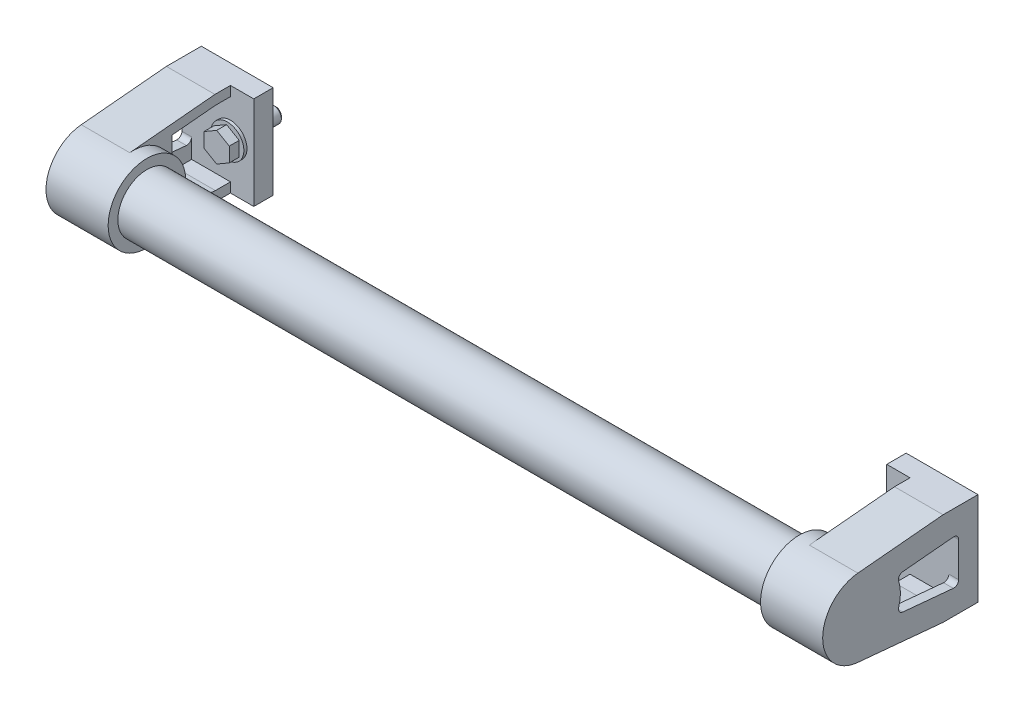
ISO-10303-21;
HEADER;
FILE_DESCRIPTION(('STEP AP214'),'2;1');
FILE_NAME('part.step','',(''),(''),'','','');
FILE_SCHEMA(('AUTOMOTIVE_DESIGN { 1 0 10303 214 1 1 1 1 }'));
ENDSEC;
DATA;
#1=APPLICATION_CONTEXT('core data for automotive mechanical design processes');
#2=APPLICATION_PROTOCOL_DEFINITION('international standard','automotive_design',2000,#1);
#3=PRODUCT_CONTEXT('',#1,'mechanical');
#4=PRODUCT('Part','Part','',(#3));
#5=PRODUCT_RELATED_PRODUCT_CATEGORY('part','',(#4));
#6=PRODUCT_DEFINITION_FORMATION('','',#4);
#7=PRODUCT_DEFINITION_CONTEXT('part definition',#1,'design');
#8=PRODUCT_DEFINITION('design','',#6,#7);
#9=PRODUCT_DEFINITION_SHAPE('','',#8);
#10=(LENGTH_UNIT() NAMED_UNIT(*) SI_UNIT(.MILLI.,.METRE.));
#11=(NAMED_UNIT(*) PLANE_ANGLE_UNIT() SI_UNIT($,.RADIAN.));
#12=(NAMED_UNIT(*) SI_UNIT($,.STERADIAN.) SOLID_ANGLE_UNIT());
#13=UNCERTAINTY_MEASURE_WITH_UNIT(LENGTH_MEASURE(1.E-05),#10,'distance_accuracy_value','');
#14=(GEOMETRIC_REPRESENTATION_CONTEXT(3) GLOBAL_UNCERTAINTY_ASSIGNED_CONTEXT((#13)) GLOBAL_UNIT_ASSIGNED_CONTEXT((#10,
#11,#12)) REPRESENTATION_CONTEXT('',''));
#15=CARTESIAN_POINT('',(0.,0.,0.));
#16=DIRECTION('',(0.,0.,1.));
#17=DIRECTION('',(1.,0.,0.));
#18=AXIS2_PLACEMENT_3D('',#15,#16,#17);
#19=CARTESIAN_POINT('',(350.,-1.92120624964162E-13,17.1));
#20=DIRECTION('',(0.,0.,1.));
#21=DIRECTION('',(0.,1.,0.));
#22=AXIS2_PLACEMENT_3D('',#19,#20,#21);
#23=PLANE('',#22);
#24=DIRECTION('',(0.866025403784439,-0.5,0.));
#25=VECTOR('',#24,1.);
#26=CARTESIAN_POINT('',(343.5,-3.75277674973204,17.1));
#27=LINE('',#26,#25);
#28=CARTESIAN_POINT('',(343.5,-3.75277674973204,17.1));
#29=VERTEX_POINT('',#28);
#30=CARTESIAN_POINT('',(350.,-7.50555349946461,17.1));
#31=VERTEX_POINT('',#30);
#32=EDGE_CURVE('E538',#29,#31,#27,.T.);
#33=ORIENTED_EDGE('',*,*,#32,.T.);
#34=DIRECTION('',(0.866025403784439,0.5,0.));
#35=VECTOR('',#34,1.);
#36=CARTESIAN_POINT('',(350.,-7.50555349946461,17.1));
#37=LINE('',#36,#35);
#38=CARTESIAN_POINT('',(356.5,-3.75277674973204,17.1));
#39=VERTEX_POINT('',#38);
#40=EDGE_CURVE('E543',#31,#39,#37,.T.);
#41=ORIENTED_EDGE('',*,*,#40,.T.);
#42=DIRECTION('',(0.,1.,0.));
#43=VECTOR('',#42,1.);
#44=CARTESIAN_POINT('',(356.5,-3.75277674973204,17.1));
#45=LINE('',#44,#43);
#46=CARTESIAN_POINT('',(356.5,3.7527767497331,17.1));
#47=VERTEX_POINT('',#46);
#48=EDGE_CURVE('E1636',#39,#47,#45,.T.);
#49=ORIENTED_EDGE('',*,*,#48,.T.);
#50=DIRECTION('',(-0.866025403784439,0.5,0.));
#51=VECTOR('',#50,1.);
#52=CARTESIAN_POINT('',(356.5,3.7527767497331,17.1));
#53=LINE('',#52,#51);
#54=CARTESIAN_POINT('',(350.,7.50555349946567,17.1));
#55=VERTEX_POINT('',#54);
#56=EDGE_CURVE('E1633',#47,#55,#53,.T.);
#57=ORIENTED_EDGE('',*,*,#56,.T.);
#58=DIRECTION('',(-0.866025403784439,-0.5,0.));
#59=VECTOR('',#58,1.);
#60=CARTESIAN_POINT('',(350.,7.50555349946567,17.1));
#61=LINE('',#60,#59);
#62=CARTESIAN_POINT('',(343.5,3.7527767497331,17.1));
#63=VERTEX_POINT('',#62);
#64=EDGE_CURVE('E1630',#55,#63,#61,.T.);
#65=ORIENTED_EDGE('',*,*,#64,.T.);
#66=DIRECTION('',(0.,-1.,0.));
#67=VECTOR('',#66,1.);
#68=CARTESIAN_POINT('',(343.5,3.7527767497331,17.1));
#69=LINE('',#68,#67);
#70=EDGE_CURVE('E1626',#63,#29,#69,.T.);
#71=ORIENTED_EDGE('',*,*,#70,.T.);
#72=EDGE_LOOP('',(#33,#41,#49,#57,#65,#71));
#73=FACE_BOUND('',#72,.T.);
#74=ADVANCED_FACE('F14',(#73),#23,.T.);
#75=CARTESIAN_POINT('',(343.5,3.7527767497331,12.));
#76=DIRECTION('',(-1.,0.,0.));
#77=DIRECTION('',(0.,0.,-1.));
#78=AXIS2_PLACEMENT_3D('',#75,#76,#77);
#79=PLANE('',#78);
#80=DIRECTION('',(0.,-1.,0.));
#81=VECTOR('',#80,1.);
#82=CARTESIAN_POINT('',(343.5,3.7527767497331,12.));
#83=LINE('',#82,#81);
#84=CARTESIAN_POINT('',(343.5,3.7527767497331,12.));
#85=VERTEX_POINT('',#84);
#86=CARTESIAN_POINT('',(343.5,-3.75277674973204,12.));
#87=VERTEX_POINT('',#86);
#88=EDGE_CURVE('E1612',#85,#87,#83,.T.);
#89=ORIENTED_EDGE('',*,*,#88,.T.);
#90=DIRECTION('',(0.,0.,1.));
#91=VECTOR('',#90,1.);
#92=CARTESIAN_POINT('',(343.5,-3.75277674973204,12.));
#93=LINE('',#92,#91);
#94=EDGE_CURVE('E1309',#87,#29,#93,.T.);
#95=ORIENTED_EDGE('',*,*,#94,.T.);
#96=ORIENTED_EDGE('',*,*,#70,.F.);
#97=DIRECTION('',(0.,0.,1.));
#98=VECTOR('',#97,1.);
#99=CARTESIAN_POINT('',(343.5,3.7527767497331,12.));
#100=LINE('',#99,#98);
#101=EDGE_CURVE('E1621',#85,#63,#100,.T.);
#102=ORIENTED_EDGE('',*,*,#101,.F.);
#103=EDGE_LOOP('',(#89,#95,#96,#102));
#104=FACE_BOUND('',#103,.T.);
#105=ADVANCED_FACE('F766',(#104),#79,.T.);
#106=CARTESIAN_POINT('',(343.5,-3.75277674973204,12.));
#107=DIRECTION('',(-0.5,-0.866025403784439,0.));
#108=DIRECTION('',(0.866025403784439,-0.5,0.));
#109=AXIS2_PLACEMENT_3D('',#106,#107,#108);
#110=PLANE('',#109);
#111=ORIENTED_EDGE('',*,*,#32,.F.);
#112=ORIENTED_EDGE('',*,*,#94,.F.);
#113=DIRECTION('',(0.866025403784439,-0.5,0.));
#114=VECTOR('',#113,1.);
#115=CARTESIAN_POINT('',(343.5,-3.75277674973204,12.));
#116=LINE('',#115,#114);
#117=CARTESIAN_POINT('',(350.,-7.50555349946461,12.));
#118=VERTEX_POINT('',#117);
#119=EDGE_CURVE('E1629',#87,#118,#116,.T.);
#120=ORIENTED_EDGE('',*,*,#119,.T.);
#121=DIRECTION('',(0.,0.,1.));
#122=VECTOR('',#121,1.);
#123=CARTESIAN_POINT('',(350.,-7.50555349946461,12.));
#124=LINE('',#123,#122);
#125=EDGE_CURVE('E1608',#118,#31,#124,.T.);
#126=ORIENTED_EDGE('',*,*,#125,.T.);
#127=EDGE_LOOP('',(#111,#112,#120,#126));
#128=FACE_BOUND('',#127,.T.);
#129=ADVANCED_FACE('F773',(#128),#110,.T.);
#130=CARTESIAN_POINT('',(350.,-7.50555349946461,12.));
#131=DIRECTION('',(0.5,-0.866025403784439,0.));
#132=DIRECTION('',(0.866025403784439,0.5,0.));
#133=AXIS2_PLACEMENT_3D('',#130,#131,#132);
#134=PLANE('',#133);
#135=ORIENTED_EDGE('',*,*,#40,.F.);
#136=ORIENTED_EDGE('',*,*,#125,.F.);
#137=DIRECTION('',(0.866025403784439,0.5,0.));
#138=VECTOR('',#137,1.);
#139=CARTESIAN_POINT('',(350.,-7.50555349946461,12.));
#140=LINE('',#139,#138);
#141=CARTESIAN_POINT('',(356.5,-3.75277674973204,12.));
#142=VERTEX_POINT('',#141);
#143=EDGE_CURVE('E1652',#118,#142,#140,.T.);
#144=ORIENTED_EDGE('',*,*,#143,.T.);
#145=DIRECTION('',(0.,0.,1.));
#146=VECTOR('',#145,1.);
#147=CARTESIAN_POINT('',(356.5,-3.75277674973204,12.));
#148=LINE('',#147,#146);
#149=EDGE_CURVE('E1611',#142,#39,#148,.T.);
#150=ORIENTED_EDGE('',*,*,#149,.T.);
#151=EDGE_LOOP('',(#135,#136,#144,#150));
#152=FACE_BOUND('',#151,.T.);
#153=ADVANCED_FACE('F1795',(#152),#134,.T.);
#154=CARTESIAN_POINT('',(356.5,-3.75277674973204,12.));
#155=DIRECTION('',(1.,0.,0.));
#156=DIRECTION('',(0.,0.,1.));
#157=AXIS2_PLACEMENT_3D('',#154,#155,#156);
#158=PLANE('',#157);
#159=DIRECTION('',(0.,1.,0.));
#160=VECTOR('',#159,1.);
#161=CARTESIAN_POINT('',(356.5,-3.75277674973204,12.));
#162=LINE('',#161,#160);
#163=CARTESIAN_POINT('',(356.5,3.7527767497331,12.));
#164=VERTEX_POINT('',#163);
#165=EDGE_CURVE('E1649',#142,#164,#162,.T.);
#166=ORIENTED_EDGE('',*,*,#165,.T.);
#167=DIRECTION('',(0.,0.,1.));
#168=VECTOR('',#167,1.);
#169=CARTESIAN_POINT('',(356.5,3.7527767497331,12.));
#170=LINE('',#169,#168);
#171=EDGE_CURVE('E1615',#164,#47,#170,.T.);
#172=ORIENTED_EDGE('',*,*,#171,.T.);
#173=ORIENTED_EDGE('',*,*,#48,.F.);
#174=ORIENTED_EDGE('',*,*,#149,.F.);
#175=EDGE_LOOP('',(#166,#172,#173,#174));
#176=FACE_BOUND('',#175,.T.);
#177=ADVANCED_FACE('F1793',(#176),#158,.T.);
#178=CARTESIAN_POINT('',(356.5,3.7527767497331,12.));
#179=DIRECTION('',(0.5,0.866025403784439,0.));
#180=DIRECTION('',(-0.866025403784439,0.5,0.));
#181=AXIS2_PLACEMENT_3D('',#178,#179,#180);
#182=PLANE('',#181);
#183=DIRECTION('',(-0.866025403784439,0.5,0.));
#184=VECTOR('',#183,1.);
#185=CARTESIAN_POINT('',(356.5,3.7527767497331,12.));
#186=LINE('',#185,#184);
#187=CARTESIAN_POINT('',(350.,7.50555349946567,12.));
#188=VERTEX_POINT('',#187);
#189=EDGE_CURVE('E1646',#164,#188,#186,.T.);
#190=ORIENTED_EDGE('',*,*,#189,.T.);
#191=DIRECTION('',(0.,0.,1.));
#192=VECTOR('',#191,1.);
#193=CARTESIAN_POINT('',(350.,7.50555349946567,12.));
#194=LINE('',#193,#192);
#195=EDGE_CURVE('E1618',#188,#55,#194,.T.);
#196=ORIENTED_EDGE('',*,*,#195,.T.);
#197=ORIENTED_EDGE('',*,*,#56,.F.);
#198=ORIENTED_EDGE('',*,*,#171,.F.);
#199=EDGE_LOOP('',(#190,#196,#197,#198));
#200=FACE_BOUND('',#199,.T.);
#201=ADVANCED_FACE('F1786',(#200),#182,.T.);
#202=CARTESIAN_POINT('',(350.,7.50555349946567,12.));
#203=DIRECTION('',(-0.5,0.866025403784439,0.));
#204=DIRECTION('',(-0.866025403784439,-0.5,0.));
#205=AXIS2_PLACEMENT_3D('',#202,#203,#204);
#206=PLANE('',#205);
#207=DIRECTION('',(-0.866025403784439,-0.5,0.));
#208=VECTOR('',#207,1.);
#209=CARTESIAN_POINT('',(350.,7.50555349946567,12.));
#210=LINE('',#209,#208);
#211=EDGE_CURVE('E1643',#188,#85,#210,.T.);
#212=ORIENTED_EDGE('',*,*,#211,.T.);
#213=ORIENTED_EDGE('',*,*,#101,.T.);
#214=ORIENTED_EDGE('',*,*,#64,.F.);
#215=ORIENTED_EDGE('',*,*,#195,.F.);
#216=EDGE_LOOP('',(#212,#213,#214,#215));
#217=FACE_BOUND('',#216,.T.);
#218=ADVANCED_FACE('F1296',(#217),#206,.T.);
#219=CARTESIAN_POINT('',(356.5,0.,12.));
#220=DIRECTION('',(0.,0.,-1.));
#221=DIRECTION('',(0.,-1.,0.));
#222=AXIS2_PLACEMENT_3D('',#219,#220,#221);
#223=PLANE('',#222);
#224=CARTESIAN_POINT('',(350.,0.,12.));
#225=DIRECTION('',(0.,0.,1.));
#226=DIRECTION('',(0.,1.,0.));
#227=AXIS2_PLACEMENT_3D('',#224,#225,#226);
#228=CIRCLE('',#227,5.85000000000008);
#229=CARTESIAN_POINT('',(350.,5.85000000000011,12.0000000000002));
#230=VERTEX_POINT('',#229);
#231=EDGE_CURVE('E1305',#230,#230,#228,.F.);
#232=ORIENTED_EDGE('',*,*,#231,.F.);
#233=EDGE_LOOP('',(#232));
#234=FACE_BOUND('',#233,.T.);
#235=ORIENTED_EDGE('',*,*,#211,.F.);
#236=ORIENTED_EDGE('',*,*,#189,.F.);
#237=ORIENTED_EDGE('',*,*,#165,.F.);
#238=ORIENTED_EDGE('',*,*,#143,.F.);
#239=ORIENTED_EDGE('',*,*,#119,.F.);
#240=ORIENTED_EDGE('',*,*,#88,.F.);
#241=EDGE_LOOP('',(#235,#236,#237,#238,#239,#240));
#242=FACE_BOUND('',#241,.T.);
#243=ADVANCED_FACE('F778',(#234,#242),#223,.T.);
#244=CARTESIAN_POINT('',(350.,1.08463585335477E-12,-13.4));
#245=DIRECTION('',(0.,0.,1.));
#246=DIRECTION('',(0.,1.,0.));
#247=AXIS2_PLACEMENT_3D('',#244,#245,#246);
#248=PLANE('',#247);
#249=CARTESIAN_POINT('',(350.,1.09012871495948E-12,-13.4));
#250=DIRECTION('',(0.,0.,1.));
#251=DIRECTION('',(0.,1.,0.));
#252=AXIS2_PLACEMENT_3D('',#249,#250,#251);
#253=CIRCLE('',#252,2.79999999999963);
#254=CARTESIAN_POINT('',(350.,2.80000000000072,-13.3999999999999));
#255=VERTEX_POINT('',#254);
#256=EDGE_CURVE('E24',#255,#255,#253,.F.);
#257=ORIENTED_EDGE('',*,*,#256,.T.);
#258=EDGE_LOOP('',(#257));
#259=FACE_BOUND('',#258,.T.);
#260=ADVANCED_FACE('F1288',(#259),#248,.F.);
#261=CARTESIAN_POINT('',(350.,-2.80114473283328E-12,80.));
#262=DIRECTION('',(0.,0.,1.));
#263=DIRECTION('',(0.,1.,0.));
#264=AXIS2_PLACEMENT_3D('',#261,#262,#263);
#265=CYLINDRICAL_SURFACE('',#264,5.85000000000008);
#266=ORIENTED_EDGE('',*,*,#231,.T.);
#267=EDGE_LOOP('',(#266));
#268=FACE_BOUND('',#267,.T.);
#269=CARTESIAN_POINT('',(350.,0.,11.6));
#270=DIRECTION('',(0.,0.,1.));
#271=DIRECTION('',(0.,1.,0.));
#272=AXIS2_PLACEMENT_3D('',#269,#270,#271);
#273=CIRCLE('',#272,5.85000000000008);
#274=CARTESIAN_POINT('',(350.,5.85000000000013,11.6000000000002));
#275=VERTEX_POINT('',#274);
#276=EDGE_CURVE('E1308',#275,#275,#273,.F.);
#277=ORIENTED_EDGE('',*,*,#276,.F.);
#278=EDGE_LOOP('',(#277));
#279=FACE_BOUND('',#278,.T.);
#280=ADVANCED_FACE('F783',(#268,#279),#265,.T.);
#281=CARTESIAN_POINT('',(350.,1.04016867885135E-12,-12.2));
#282=DIRECTION('',(0.,0.,1.));
#283=DIRECTION('',(0.,1.,0.));
#284=AXIS2_PLACEMENT_3D('',#281,#282,#283);
#285=CONICAL_SURFACE('',#284,3.99999999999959,0.785398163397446);
#286=ORIENTED_EDGE('',*,*,#256,.F.);
#287=EDGE_LOOP('',(#286));
#288=FACE_BOUND('',#287,.T.);
#289=CARTESIAN_POINT('',(350.,1.04016867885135E-12,-12.2));
#290=DIRECTION('',(0.,0.,1.));
#291=DIRECTION('',(0.,1.,0.));
#292=AXIS2_PLACEMENT_3D('',#289,#290,#291);
#293=CIRCLE('',#292,3.99999999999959);
#294=CARTESIAN_POINT('',(350.,4.00000000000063,-12.1999999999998));
#295=VERTEX_POINT('',#294);
#296=EDGE_CURVE('E1300',#295,#295,#293,.T.);
#297=ORIENTED_EDGE('',*,*,#296,.F.);
#298=EDGE_LOOP('',(#297));
#299=FACE_BOUND('',#298,.T.);
#300=ADVANCED_FACE('F780',(#288,#299),#285,.T.);
#301=CARTESIAN_POINT('',(355.85,0.,11.6));
#302=DIRECTION('',(0.,0.,1.));
#303=DIRECTION('',(0.,1.,0.));
#304=AXIS2_PLACEMENT_3D('',#301,#302,#303);
#305=PLANE('',#304);
#306=CARTESIAN_POINT('',(350.,0.,11.6));
#307=DIRECTION('',(0.,0.,1.));
#308=DIRECTION('',(0.,1.,0.));
#309=AXIS2_PLACEMENT_3D('',#306,#307,#308);
#310=CIRCLE('',#309,8.50000000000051);
#311=CARTESIAN_POINT('',(350.,8.50000000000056,11.6000000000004));
#312=VERTEX_POINT('',#311);
#313=EDGE_CURVE('E1312',#312,#312,#310,.F.);
#314=ORIENTED_EDGE('',*,*,#313,.F.);
#315=EDGE_LOOP('',(#314));
#316=FACE_BOUND('',#315,.T.);
#317=ORIENTED_EDGE('',*,*,#276,.T.);
#318=EDGE_LOOP('',(#317));
#319=FACE_BOUND('',#318,.T.);
#320=ADVANCED_FACE('F782',(#316,#319),#305,.T.);
#321=CARTESIAN_POINT('',(350.,0.,12.7319341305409));
#322=DIRECTION('',(0.,0.,1.));
#323=DIRECTION('',(0.,1.,0.));
#324=AXIS2_PLACEMENT_3D('',#321,#322,#323);
#325=CYLINDRICAL_SURFACE('',#324,3.99999999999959);
#326=ORIENTED_EDGE('',*,*,#296,.T.);
#327=EDGE_LOOP('',(#326));
#328=FACE_BOUND('',#327,.T.);
#329=CARTESIAN_POINT('',(350.,5.3224164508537E-13,0.));
#330=DIRECTION('',(0.,0.,1.));
#331=DIRECTION('',(0.,1.,0.));
#332=AXIS2_PLACEMENT_3D('',#329,#330,#331);
#333=CIRCLE('',#332,3.99999999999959);
#334=CARTESIAN_POINT('',(350.,4.00000000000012,1.17961196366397E-13));
#335=VERTEX_POINT('',#334);
#336=EDGE_CURVE('E1316',#335,#335,#333,.T.);
#337=ORIENTED_EDGE('',*,*,#336,.F.);
#338=EDGE_LOOP('',(#337));
#339=FACE_BOUND('',#338,.T.);
#340=ADVANCED_FACE('F1281',(#328,#339),#325,.T.);
#341=CARTESIAN_POINT('',(350.,-2.80114473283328E-12,80.));
#342=DIRECTION('',(0.,0.,1.));
#343=DIRECTION('',(0.,1.,0.));
#344=AXIS2_PLACEMENT_3D('',#341,#342,#343);
#345=CYLINDRICAL_SURFACE('',#344,8.50000000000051);
#346=ORIENTED_EDGE('',*,*,#313,.T.);
#347=EDGE_LOOP('',(#346));
#348=FACE_BOUND('',#347,.T.);
#349=CARTESIAN_POINT('',(350.,1.13190706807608E-13,10.));
#350=DIRECTION('',(0.,0.,1.));
#351=DIRECTION('',(0.,1.,0.));
#352=AXIS2_PLACEMENT_3D('',#349,#350,#351);
#353=CIRCLE('',#352,8.50000000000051);
#354=CARTESIAN_POINT('',(350.,8.50000000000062,10.0000000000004));
#355=VERTEX_POINT('',#354);
#356=EDGE_CURVE('E1335',#355,#355,#353,.T.);
#357=ORIENTED_EDGE('',*,*,#356,.T.);
#358=EDGE_LOOP('',(#357));
#359=FACE_BOUND('',#358,.T.);
#360=ADVANCED_FACE('F1274',(#348,#359),#345,.T.);
#361=CARTESIAN_POINT('',(370.,18.9999999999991,40.0000000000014));
#362=DIRECTION('',(-1.,0.,0.));
#363=DIRECTION('',(0.,0.,-1.));
#364=AXIS2_PLACEMENT_3D('',#361,#362,#363);
#365=PLANE('',#364);
#366=DIRECTION('',(0.,-1.,0.));
#367=VECTOR('',#366,1.);
#368=CARTESIAN_POINT('',(370.,8.9453276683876,10.0000000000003));
#369=LINE('',#368,#367);
#370=CARTESIAN_POINT('',(370.,-8.94532766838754,9.99999999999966));
#371=VERTEX_POINT('',#370);
#372=CARTESIAN_POINT('',(370.,-19.,9.99999999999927));
#373=VERTEX_POINT('',#372);
#374=EDGE_CURVE('E1423',#371,#373,#369,.T.);
#375=ORIENTED_EDGE('',*,*,#374,.T.);
#376=DIRECTION('',(0.,0.,-1.));
#377=VECTOR('',#376,1.);
#378=CARTESIAN_POINT('',(370.,-19.,9.99999999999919));
#379=LINE('',#378,#377);
#380=CARTESIAN_POINT('',(370.,-19.,17.7675646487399));
#381=VERTEX_POINT('',#380);
#382=EDGE_CURVE('E1320',#381,#373,#379,.T.);
#383=ORIENTED_EDGE('',*,*,#382,.F.);
#384=DIRECTION('',(0.,-0.0927736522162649,-0.995687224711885));
#385=VECTOR('',#384,1.);
#386=CARTESIAN_POINT('',(370.,-19.,17.7675646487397));
#387=LINE('',#386,#385);
#388=CARTESIAN_POINT('',(370.,-16.9284817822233,40.));
#389=VERTEX_POINT('',#388);
#390=EDGE_CURVE('E1390',#389,#381,#387,.T.);
#391=ORIENTED_EDGE('',*,*,#390,.F.);
#392=DIRECTION('',(0.,-1.,0.));
#393=VECTOR('',#392,1.);
#394=CARTESIAN_POINT('',(370.,23.9999999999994,40.0000000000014));
#395=LINE('',#394,#393);
#396=CARTESIAN_POINT('',(370.,-8.50076165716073,40.));
#397=VERTEX_POINT('',#396);
#398=EDGE_CURVE('E1397',#397,#389,#395,.T.);
#399=ORIENTED_EDGE('',*,*,#398,.F.);
#400=CARTESIAN_POINT('',(370.,-6.5258254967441,38.4671506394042));
#401=DIRECTION('',(1.,0.,0.));
#402=DIRECTION('',(0.,0.,1.));
#403=AXIS2_PLACEMENT_3D('',#400,#401,#402);
#404=CIRCLE('',#403,2.5);
#405=CARTESIAN_POINT('',(370.,-9.01504355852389,38.699084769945));
#406=VERTEX_POINT('',#405);
#407=EDGE_CURVE('E1324',#397,#406,#404,.T.);
#408=ORIENTED_EDGE('',*,*,#407,.T.);
#409=DIRECTION('',(0.,0.0927736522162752,0.995687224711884));
#410=VECTOR('',#409,1.);
#411=CARTESIAN_POINT('',(370.,-11.4345457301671,12.7319341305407));
#412=LINE('',#411,#410);
#413=CARTESIAN_POINT('',(370.,-11.4345457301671,12.7319341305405));
#414=VERTEX_POINT('',#413);
#415=EDGE_CURVE('E1323',#406,#414,#412,.F.);
#416=ORIENTED_EDGE('',*,*,#415,.T.);
#417=CARTESIAN_POINT('',(370.,-8.94532766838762,12.4999999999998));
#418=DIRECTION('',(1.,0.,0.));
#419=DIRECTION('',(0.,0.,1.));
#420=AXIS2_PLACEMENT_3D('',#417,#418,#419);
#421=CIRCLE('',#420,2.5);
#422=EDGE_CURVE('E1321',#414,#371,#421,.T.);
#423=ORIENTED_EDGE('',*,*,#422,.T.);
#424=EDGE_LOOP('',(#375,#383,#391,#399,#408,#416,#423));
#425=FACE_BOUND('',#424,.T.);
#426=ADVANCED_FACE('F1271',(#425),#365,.T.);
#427=CARTESIAN_POINT('',(370.,18.9999999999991,40.0000000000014));
#428=DIRECTION('',(-1.,0.,0.));
#429=DIRECTION('',(0.,0.,-1.));
#430=AXIS2_PLACEMENT_3D('',#427,#428,#429);
#431=PLANE('',#430);
#432=DIRECTION('',(0.,-1.,0.));
#433=VECTOR('',#432,1.);
#434=CARTESIAN_POINT('',(370.,23.9999999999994,40.0000000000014));
#435=LINE('',#434,#433);
#436=CARTESIAN_POINT('',(370.,16.9284817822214,40.0000000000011));
#437=VERTEX_POINT('',#436);
#438=CARTESIAN_POINT('',(370.,8.50076165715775,40.0000000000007));
#439=VERTEX_POINT('',#438);
#440=EDGE_CURVE('E1400',#437,#439,#435,.T.);
#441=ORIENTED_EDGE('',*,*,#440,.F.);
#442=DIRECTION('',(0.,0.0927736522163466,-0.995687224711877));
#443=VECTOR('',#442,1.);
#444=CARTESIAN_POINT('',(370.,19.,17.7675646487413));
#445=LINE('',#444,#443);
#446=CARTESIAN_POINT('',(370.,19.,17.7675646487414));
#447=VERTEX_POINT('',#446);
#448=EDGE_CURVE('E1384',#437,#447,#445,.T.);
#449=ORIENTED_EDGE('',*,*,#448,.T.);
#450=DIRECTION('',(0.,0.,-1.));
#451=VECTOR('',#450,1.);
#452=CARTESIAN_POINT('',(370.,19.0000000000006,10.0000000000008));
#453=LINE('',#452,#451);
#454=CARTESIAN_POINT('',(370.,19.0000000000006,10.0000000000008));
#455=VERTEX_POINT('',#454);
#456=EDGE_CURVE('E1315',#447,#455,#453,.T.);
#457=ORIENTED_EDGE('',*,*,#456,.T.);
#458=DIRECTION('',(0.,-1.,0.));
#459=VECTOR('',#458,1.);
#460=CARTESIAN_POINT('',(370.,8.9453276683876,10.0000000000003));
#461=LINE('',#460,#459);
#462=CARTESIAN_POINT('',(370.,8.94532766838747,10.0000000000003));
#463=VERTEX_POINT('',#462);
#464=EDGE_CURVE('E1417',#455,#463,#461,.T.);
#465=ORIENTED_EDGE('',*,*,#464,.T.);
#466=CARTESIAN_POINT('',(370.,8.94532766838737,12.5000000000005));
#467=DIRECTION('',(1.,0.,0.));
#468=DIRECTION('',(0.,0.,1.));
#469=AXIS2_PLACEMENT_3D('',#466,#467,#468);
#470=CIRCLE('',#469,2.5);
#471=CARTESIAN_POINT('',(370.,11.434545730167,12.7319341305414));
#472=VERTEX_POINT('',#471);
#473=EDGE_CURVE('E1331',#463,#472,#470,.T.);
#474=ORIENTED_EDGE('',*,*,#473,.T.);
#475=DIRECTION('',(0.,-0.0927736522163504,0.995687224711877));
#476=VECTOR('',#475,1.);
#477=CARTESIAN_POINT('',(370.,11.4345457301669,12.7319341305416));
#478=LINE('',#477,#476);
#479=CARTESIAN_POINT('',(370.,9.01504355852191,38.6990847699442));
#480=VERTEX_POINT('',#479);
#481=EDGE_CURVE('E1334',#480,#472,#478,.F.);
#482=ORIENTED_EDGE('',*,*,#481,.F.);
#483=CARTESIAN_POINT('',(370.,6.52582549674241,38.4671506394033));
#484=DIRECTION('',(1.,0.,0.));
#485=DIRECTION('',(0.,0.,1.));
#486=AXIS2_PLACEMENT_3D('',#483,#484,#485);
#487=CIRCLE('',#486,2.5);
#488=EDGE_CURVE('E1328',#480,#439,#487,.T.);
#489=ORIENTED_EDGE('',*,*,#488,.T.);
#490=EDGE_LOOP('',(#441,#449,#457,#465,#474,#482,#489));
#491=FACE_BOUND('',#490,.T.);
#492=ADVANCED_FACE('F1250',(#491),#431,.T.);
#493=CARTESIAN_POINT('',(338.,24.0000000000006,10.0000000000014));
#494=DIRECTION('',(-1.,0.,0.));
#495=DIRECTION('',(0.,0.,-1.));
#496=AXIS2_PLACEMENT_3D('',#493,#494,#495);
#497=PLANE('',#496);
#498=DIRECTION('',(0.,-1.,0.));
#499=VECTOR('',#498,1.);
#500=CARTESIAN_POINT('',(338.,24.0000000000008,9.5062846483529E-13));
#501=LINE('',#500,#499);
#502=CARTESIAN_POINT('',(338.,-23.9999999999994,-1.01076554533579E-12));
#503=VERTEX_POINT('',#502);
#504=CARTESIAN_POINT('',(338.,24.0000000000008,9.5062846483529E-13));
#505=VERTEX_POINT('',#504);
#506=EDGE_CURVE('E1319',#503,#505,#501,.F.);
#507=ORIENTED_EDGE('',*,*,#506,.F.);
#508=DIRECTION('',(0.,0.,1.));
#509=VECTOR('',#508,1.);
#510=CARTESIAN_POINT('',(338.,-23.9999999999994,-1.04777297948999E-12));
#511=LINE('',#510,#509);
#512=CARTESIAN_POINT('',(338.,-24.,9.99999999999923));
#513=VERTEX_POINT('',#512);
#514=EDGE_CURVE('E1510',#513,#503,#511,.F.);
#515=ORIENTED_EDGE('',*,*,#514,.F.);
#516=DIRECTION('',(0.,-1.,0.));
#517=VECTOR('',#516,1.);
#518=CARTESIAN_POINT('',(338.,8.9453276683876,10.0000000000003));
#519=LINE('',#518,#517);
#520=CARTESIAN_POINT('',(338.,24.0000000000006,10.0000000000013));
#521=VERTEX_POINT('',#520);
#522=EDGE_CURVE('E1338',#513,#521,#519,.F.);
#523=ORIENTED_EDGE('',*,*,#522,.T.);
#524=DIRECTION('',(0.,0.,1.));
#525=VECTOR('',#524,1.);
#526=CARTESIAN_POINT('',(338.,24.0000000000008,9.5062846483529E-13));
#527=LINE('',#526,#525);
#528=EDGE_CURVE('E1341',#521,#505,#527,.F.);
#529=ORIENTED_EDGE('',*,*,#528,.T.);
#530=EDGE_LOOP('',(#507,#515,#523,#529));
#531=FACE_BOUND('',#530,.T.);
#532=ADVANCED_FACE('F1246',(#531),#497,.T.);
#533=CARTESIAN_POINT('',(361.,-19.,9.99999999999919));
#534=DIRECTION('',(0.,1.,0.));
#535=DIRECTION('',(0.,0.,-1.));
#536=AXIS2_PLACEMENT_3D('',#533,#534,#535);
#537=PLANE('',#536);
#538=DIRECTION('',(-1.,0.,0.));
#539=VECTOR('',#538,1.);
#540=CARTESIAN_POINT('',(334.,-19.,9.99999999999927));
#541=LINE('',#540,#539);
#542=CARTESIAN_POINT('',(350.,-19.,9.99999999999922));
#543=VERTEX_POINT('',#542);
#544=EDGE_CURVE('E1426',#373,#543,#541,.T.);
#545=ORIENTED_EDGE('',*,*,#544,.T.);
#546=DIRECTION('',(0.,0.,-1.));
#547=VECTOR('',#546,1.);
#548=CARTESIAN_POINT('',(350.,-19.,60.));
#549=LINE('',#548,#547);
#550=CARTESIAN_POINT('',(350.,-19.,17.7675646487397));
#551=VERTEX_POINT('',#550);
#552=EDGE_CURVE('E1482',#551,#543,#549,.T.);
#553=ORIENTED_EDGE('',*,*,#552,.F.);
#554=DIRECTION('',(-1.,0.,0.));
#555=VECTOR('',#554,1.);
#556=CARTESIAN_POINT('',(361.,-19.,17.7675646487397));
#557=LINE('',#556,#555);
#558=EDGE_CURVE('E1393',#551,#381,#557,.F.);
#559=ORIENTED_EDGE('',*,*,#558,.T.);
#560=ORIENTED_EDGE('',*,*,#382,.T.);
#561=EDGE_LOOP('',(#545,#553,#559,#560));
#562=FACE_BOUND('',#561,.T.);
#563=ADVANCED_FACE('F1249',(#562),#537,.T.);
#564=CARTESIAN_POINT('',(361.,-19.,17.7675646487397));
#565=DIRECTION('',(0.,0.995687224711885,-0.0927736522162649));
#566=DIRECTION('',(0.,-0.0927736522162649,-0.995687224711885));
#567=AXIS2_PLACEMENT_3D('',#564,#565,#566);
#568=PLANE('',#567);
#569=ORIENTED_EDGE('',*,*,#558,.F.);
#570=DIRECTION('',(0.,-0.0927736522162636,-0.995687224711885));
#571=VECTOR('',#570,1.);
#572=CARTESIAN_POINT('',(350.,-16.9284817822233,40.));
#573=LINE('',#572,#571);
#574=CARTESIAN_POINT('',(350.,-16.9284817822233,40.));
#575=VERTEX_POINT('',#574);
#576=EDGE_CURVE('E1479',#575,#551,#573,.T.);
#577=ORIENTED_EDGE('',*,*,#576,.F.);
#578=DIRECTION('',(-1.,0.,0.));
#579=VECTOR('',#578,1.);
#580=CARTESIAN_POINT('',(361.,-16.9284817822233,40.));
#581=LINE('',#580,#579);
#582=EDGE_CURVE('E1394',#575,#389,#581,.F.);
#583=ORIENTED_EDGE('',*,*,#582,.T.);
#584=ORIENTED_EDGE('',*,*,#390,.T.);
#585=EDGE_LOOP('',(#569,#577,#583,#584));
#586=FACE_BOUND('',#585,.T.);
#587=ADVANCED_FACE('F1254',(#586),#568,.T.);
#588=CARTESIAN_POINT('',(346.,23.9999999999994,40.0000000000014));
#589=DIRECTION('',(0.,0.,-1.));
#590=DIRECTION('',(0.,-1.,0.));
#591=AXIS2_PLACEMENT_3D('',#588,#589,#590);
#592=PLANE('',#591);
#593=DIRECTION('',(1.,0.,0.));
#594=VECTOR('',#593,1.);
#595=CARTESIAN_POINT('',(334.,-8.50076165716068,40.));
#596=LINE('',#595,#594);
#597=CARTESIAN_POINT('',(350.,-8.50076165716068,40.));
#598=VERTEX_POINT('',#597);
#599=EDGE_CURVE('E1327',#598,#397,#596,.T.);
#600=ORIENTED_EDGE('',*,*,#599,.T.);
#601=ORIENTED_EDGE('',*,*,#398,.T.);
#602=ORIENTED_EDGE('',*,*,#582,.F.);
#603=DIRECTION('',(0.,-1.,0.));
#604=VECTOR('',#603,1.);
#605=CARTESIAN_POINT('',(350.,-2.09337755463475E-12,40.));
#606=LINE('',#605,#604);
#607=EDGE_CURVE('E1467',#598,#575,#606,.T.);
#608=ORIENTED_EDGE('',*,*,#607,.F.);
#609=EDGE_LOOP('',(#600,#601,#602,#608));
#610=FACE_BOUND('',#609,.T.);
#611=ADVANCED_FACE('F1244',(#610),#592,.T.);
#612=CARTESIAN_POINT('',(334.,24.0000000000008,9.5062846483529E-13));
#613=DIRECTION('',(0.,0.,-1.));
#614=DIRECTION('',(0.,-1.,0.));
#615=AXIS2_PLACEMENT_3D('',#612,#613,#614);
#616=PLANE('',#615);
#617=DIRECTION('',(-1.,0.,0.));
#618=VECTOR('',#617,1.);
#619=CARTESIAN_POINT('',(334.,24.0000000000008,9.5062846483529E-13));
#620=LINE('',#619,#618);
#621=CARTESIAN_POINT('',(375.,24.0000000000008,-3.81639164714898E-13));
#622=VERTEX_POINT('',#621);
#623=EDGE_CURVE('E1461',#505,#622,#620,.F.);
#624=ORIENTED_EDGE('',*,*,#623,.T.);
#625=DIRECTION('',(0.,-1.,0.));
#626=VECTOR('',#625,1.);
#627=CARTESIAN_POINT('',(375.,-2.09337755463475E-12,-1.04777297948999E-12));
#628=LINE('',#627,#626);
#629=CARTESIAN_POINT('',(375.,-24.,-1.04777297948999E-12));
#630=VERTEX_POINT('',#629);
#631=EDGE_CURVE('E1352',#630,#622,#628,.F.);
#632=ORIENTED_EDGE('',*,*,#631,.F.);
#633=DIRECTION('',(-1.,0.,0.));
#634=VECTOR('',#633,1.);
#635=CARTESIAN_POINT('',(334.,-23.9999999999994,-1.04777297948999E-12));
#636=LINE('',#635,#634);
#637=EDGE_CURVE('E1515',#503,#630,#636,.F.);
#638=ORIENTED_EDGE('',*,*,#637,.F.);
#639=ORIENTED_EDGE('',*,*,#506,.T.);
#640=EDGE_LOOP('',(#624,#632,#638,#639));
#641=FACE_BOUND('',#640,.T.);
#642=ORIENTED_EDGE('',*,*,#336,.T.);
#643=EDGE_LOOP('',(#642));
#644=FACE_BOUND('',#643,.T.);
#645=ADVANCED_FACE('F1203',(#641,#644),#616,.T.);
#646=CARTESIAN_POINT('',(334.,-23.9999999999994,-1.04777297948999E-12));
#647=DIRECTION('',(0.,-1.,0.));
#648=DIRECTION('',(0.,0.,1.));
#649=AXIS2_PLACEMENT_3D('',#646,#647,#648);
#650=PLANE('',#649);
#651=DIRECTION('',(0.,0.,1.));
#652=VECTOR('',#651,1.);
#653=CARTESIAN_POINT('',(375.,-24.0000000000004,60.));
#654=LINE('',#653,#652);
#655=CARTESIAN_POINT('',(375.,-24.0000000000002,17.999999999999));
#656=VERTEX_POINT('',#655);
#657=EDGE_CURVE('E1528',#656,#630,#654,.F.);
#658=ORIENTED_EDGE('',*,*,#657,.F.);
#659=DIRECTION('',(-1.,0.,0.));
#660=VECTOR('',#659,1.);
#661=CARTESIAN_POINT('',(334.,-24.,17.999999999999));
#662=LINE('',#661,#660);
#663=CARTESIAN_POINT('',(350.,-24.0000000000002,17.999999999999));
#664=VERTEX_POINT('',#663);
#665=EDGE_CURVE('E1580',#664,#656,#662,.F.);
#666=ORIENTED_EDGE('',*,*,#665,.F.);
#667=DIRECTION('',(0.,0.,1.));
#668=VECTOR('',#667,1.);
#669=CARTESIAN_POINT('',(350.,-23.9999999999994,-1.04777297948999E-12));
#670=LINE('',#669,#668);
#671=CARTESIAN_POINT('',(350.,-24.,9.99999999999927));
#672=VERTEX_POINT('',#671);
#673=EDGE_CURVE('E1346',#664,#672,#670,.F.);
#674=ORIENTED_EDGE('',*,*,#673,.T.);
#675=DIRECTION('',(-1.,0.,0.));
#676=VECTOR('',#675,1.);
#677=CARTESIAN_POINT('',(334.,-24.,9.99999999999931));
#678=LINE('',#677,#676);
#679=EDGE_CURVE('E1507',#672,#513,#678,.T.);
#680=ORIENTED_EDGE('',*,*,#679,.T.);
#681=ORIENTED_EDGE('',*,*,#514,.T.);
#682=ORIENTED_EDGE('',*,*,#637,.T.);
#683=EDGE_LOOP('',(#658,#666,#674,#680,#681,#682));
#684=FACE_BOUND('',#683,.T.);
#685=ADVANCED_FACE('F1199',(#684),#650,.T.);
#686=CARTESIAN_POINT('',(343.,-11.4345457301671,12.7319341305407));
#687=DIRECTION('',(0.,-0.995687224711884,0.0927736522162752));
#688=DIRECTION('',(0.,0.0927736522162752,0.995687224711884));
#689=AXIS2_PLACEMENT_3D('',#686,#687,#688);
#690=PLANE('',#689);
#691=DIRECTION('',(0.,0.0927736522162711,0.995687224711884));
#692=VECTOR('',#691,1.);
#693=CARTESIAN_POINT('',(375.,-11.4345457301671,12.7319341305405));
#694=LINE('',#693,#692);
#695=CARTESIAN_POINT('',(375.,-11.4345457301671,12.7319341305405));
#696=VERTEX_POINT('',#695);
#697=CARTESIAN_POINT('',(375.,-9.01504355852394,38.699084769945));
#698=VERTEX_POINT('',#697);
#699=EDGE_CURVE('E1351',#696,#698,#694,.T.);
#700=ORIENTED_EDGE('',*,*,#699,.F.);
#701=DIRECTION('',(-1.,0.,0.));
#702=VECTOR('',#701,1.);
#703=CARTESIAN_POINT('',(343.,-11.4345457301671,12.7319341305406));
#704=LINE('',#703,#702);
#705=EDGE_CURVE('E1402',#414,#696,#704,.F.);
#706=ORIENTED_EDGE('',*,*,#705,.F.);
#707=ORIENTED_EDGE('',*,*,#415,.F.);
#708=DIRECTION('',(1.,0.,0.));
#709=VECTOR('',#708,1.);
#710=CARTESIAN_POINT('',(334.,-9.01504355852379,38.6990847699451));
#711=LINE('',#710,#709);
#712=EDGE_CURVE('E1326',#406,#698,#711,.T.);
#713=ORIENTED_EDGE('',*,*,#712,.T.);
#714=EDGE_LOOP('',(#700,#706,#707,#713));
#715=FACE_BOUND('',#714,.T.);
#716=ADVANCED_FACE('F1202',(#715),#690,.F.);
#717=CARTESIAN_POINT('',(343.,-8.94532766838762,12.4999999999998));
#718=DIRECTION('',(1.,0.,0.));
#719=DIRECTION('',(0.,0.,1.));
#720=AXIS2_PLACEMENT_3D('',#717,#718,#719);
#721=CYLINDRICAL_SURFACE('',#720,2.5);
#722=ORIENTED_EDGE('',*,*,#705,.T.);
#723=CARTESIAN_POINT('',(375.,-8.94532766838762,12.4999999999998));
#724=DIRECTION('',(1.,0.,0.));
#725=DIRECTION('',(0.,0.,1.));
#726=AXIS2_PLACEMENT_3D('',#723,#724,#725);
#727=CIRCLE('',#726,2.5);
#728=CARTESIAN_POINT('',(375.,-8.94532766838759,10.));
#729=VERTEX_POINT('',#728);
#730=EDGE_CURVE('E1348',#729,#696,#727,.F.);
#731=ORIENTED_EDGE('',*,*,#730,.F.);
#732=DIRECTION('',(-1.,0.,0.));
#733=VECTOR('',#732,1.);
#734=CARTESIAN_POINT('',(334.,-8.94532766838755,9.99999999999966));
#735=LINE('',#734,#733);
#736=EDGE_CURVE('E1427',#729,#371,#735,.T.);
#737=ORIENTED_EDGE('',*,*,#736,.T.);
#738=ORIENTED_EDGE('',*,*,#422,.F.);
#739=EDGE_LOOP('',(#722,#731,#737,#738));
#740=FACE_BOUND('',#739,.T.);
#741=ADVANCED_FACE('F1230',(#740),#721,.F.);
#742=CARTESIAN_POINT('',(343.,8.94532766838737,12.5000000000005));
#743=DIRECTION('',(1.,0.,0.));
#744=DIRECTION('',(0.,0.,1.));
#745=AXIS2_PLACEMENT_3D('',#742,#743,#744);
#746=CYLINDRICAL_SURFACE('',#745,2.5);
#747=CARTESIAN_POINT('',(375.,8.94532766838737,12.5000000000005));
#748=DIRECTION('',(1.,0.,0.));
#749=DIRECTION('',(0.,0.,1.));
#750=AXIS2_PLACEMENT_3D('',#747,#748,#749);
#751=CIRCLE('',#750,2.5);
#752=CARTESIAN_POINT('',(375.,11.434545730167,12.7319341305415));
#753=VERTEX_POINT('',#752);
#754=CARTESIAN_POINT('',(375.,8.94532766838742,10.0000000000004));
#755=VERTEX_POINT('',#754);
#756=EDGE_CURVE('E1360',#753,#755,#751,.F.);
#757=ORIENTED_EDGE('',*,*,#756,.F.);
#758=DIRECTION('',(1.,0.,0.));
#759=VECTOR('',#758,1.);
#760=CARTESIAN_POINT('',(343.,11.434545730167,12.7319341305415));
#761=LINE('',#760,#759);
#762=EDGE_CURVE('E1333',#472,#753,#761,.T.);
#763=ORIENTED_EDGE('',*,*,#762,.F.);
#764=ORIENTED_EDGE('',*,*,#473,.F.);
#765=DIRECTION('',(-1.,0.,0.));
#766=VECTOR('',#765,1.);
#767=CARTESIAN_POINT('',(334.,8.94532766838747,10.0000000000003));
#768=LINE('',#767,#766);
#769=EDGE_CURVE('E1419',#463,#755,#768,.F.);
#770=ORIENTED_EDGE('',*,*,#769,.T.);
#771=EDGE_LOOP('',(#757,#763,#764,#770));
#772=FACE_BOUND('',#771,.T.);
#773=ADVANCED_FACE('F1226',(#772),#746,.F.);
#774=CARTESIAN_POINT('',(343.,11.4345457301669,12.7319341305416));
#775=DIRECTION('',(0.,-0.995687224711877,-0.0927736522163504));
#776=DIRECTION('',(0.,-0.0927736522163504,0.995687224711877));
#777=AXIS2_PLACEMENT_3D('',#774,#775,#776);
#778=PLANE('',#777);
#779=ORIENTED_EDGE('',*,*,#762,.T.);
#780=DIRECTION('',(0.,0.0927736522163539,-0.995687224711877));
#781=VECTOR('',#780,1.);
#782=CARTESIAN_POINT('',(375.,9.01504355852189,38.6990847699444));
#783=LINE('',#782,#781);
#784=CARTESIAN_POINT('',(375.,9.01504355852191,38.6990847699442));
#785=VERTEX_POINT('',#784);
#786=EDGE_CURVE('E1359',#785,#753,#783,.T.);
#787=ORIENTED_EDGE('',*,*,#786,.F.);
#788=DIRECTION('',(-1.,0.,0.));
#789=VECTOR('',#788,1.);
#790=CARTESIAN_POINT('',(343.,9.01504355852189,38.6990847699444));
#791=LINE('',#790,#789);
#792=EDGE_CURVE('E1410',#785,#480,#791,.T.);
#793=ORIENTED_EDGE('',*,*,#792,.T.);
#794=ORIENTED_EDGE('',*,*,#481,.T.);
#795=EDGE_LOOP('',(#779,#787,#793,#794));
#796=FACE_BOUND('',#795,.T.);
#797=ADVANCED_FACE('F1229',(#796),#778,.T.);
#798=CARTESIAN_POINT('',(361.,19.,17.7675646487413));
#799=DIRECTION('',(0.,0.995687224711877,0.0927736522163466));
#800=DIRECTION('',(0.,0.0927736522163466,-0.995687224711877));
#801=AXIS2_PLACEMENT_3D('',#798,#799,#800);
#802=PLANE('',#801);
#803=ORIENTED_EDGE('',*,*,#448,.F.);
#804=DIRECTION('',(-1.,0.,0.));
#805=VECTOR('',#804,1.);
#806=CARTESIAN_POINT('',(346.,16.9284817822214,40.0000000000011));
#807=LINE('',#806,#805);
#808=CARTESIAN_POINT('',(350.,16.9284817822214,40.0000000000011));
#809=VERTEX_POINT('',#808);
#810=EDGE_CURVE('E1407',#809,#437,#807,.F.);
#811=ORIENTED_EDGE('',*,*,#810,.F.);
#812=DIRECTION('',(0.,-0.0927736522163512,0.995687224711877));
#813=VECTOR('',#812,1.);
#814=CARTESIAN_POINT('',(350.,19.0000000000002,17.7675646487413));
#815=LINE('',#814,#813);
#816=CARTESIAN_POINT('',(350.,19.0000000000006,17.7675646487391));
#817=VERTEX_POINT('',#816);
#818=EDGE_CURVE('E1441',#817,#809,#815,.T.);
#819=ORIENTED_EDGE('',*,*,#818,.F.);
#820=DIRECTION('',(-1.,0.,0.));
#821=VECTOR('',#820,1.);
#822=CARTESIAN_POINT('',(361.,19.,17.7675646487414));
#823=LINE('',#822,#821);
#824=EDGE_CURVE('E1387',#447,#817,#823,.T.);
#825=ORIENTED_EDGE('',*,*,#824,.F.);
#826=EDGE_LOOP('',(#803,#811,#819,#825));
#827=FACE_BOUND('',#826,.T.);
#828=ADVANCED_FACE('F1234',(#827),#802,.F.);
#829=CARTESIAN_POINT('',(361.,19.0000000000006,10.0000000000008));
#830=DIRECTION('',(0.,1.,0.));
#831=DIRECTION('',(0.,0.,-1.));
#832=AXIS2_PLACEMENT_3D('',#829,#830,#831);
#833=PLANE('',#832);
#834=ORIENTED_EDGE('',*,*,#456,.F.);
#835=ORIENTED_EDGE('',*,*,#824,.T.);
#836=DIRECTION('',(0.,0.,-1.));
#837=VECTOR('',#836,1.);
#838=CARTESIAN_POINT('',(350.,19.0000000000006,38.4671506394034));
#839=LINE('',#838,#837);
#840=CARTESIAN_POINT('',(350.,19.0000000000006,10.0000000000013));
#841=VERTEX_POINT('',#840);
#842=EDGE_CURVE('E1438',#841,#817,#839,.F.);
#843=ORIENTED_EDGE('',*,*,#842,.F.);
#844=DIRECTION('',(-1.,0.,0.));
#845=VECTOR('',#844,1.);
#846=CARTESIAN_POINT('',(334.,19.0000000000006,10.0000000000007));
#847=LINE('',#846,#845);
#848=EDGE_CURVE('E1420',#841,#455,#847,.F.);
#849=ORIENTED_EDGE('',*,*,#848,.T.);
#850=EDGE_LOOP('',(#834,#835,#843,#849));
#851=FACE_BOUND('',#850,.T.);
#852=ADVANCED_FACE('F1224',(#851),#833,.F.);
#853=CARTESIAN_POINT('',(334.,8.9453276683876,10.0000000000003));
#854=DIRECTION('',(0.,0.,-1.));
#855=DIRECTION('',(0.,-1.,0.));
#856=AXIS2_PLACEMENT_3D('',#853,#854,#855);
#857=PLANE('',#856);
#858=ORIENTED_EDGE('',*,*,#544,.F.);
#859=ORIENTED_EDGE('',*,*,#374,.F.);
#860=ORIENTED_EDGE('',*,*,#736,.F.);
#861=DIRECTION('',(0.,-1.,0.));
#862=VECTOR('',#861,1.);
#863=CARTESIAN_POINT('',(375.,-2.09337755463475E-12,10.0000000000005));
#864=LINE('',#863,#862);
#865=EDGE_CURVE('E1363',#755,#729,#864,.T.);
#866=ORIENTED_EDGE('',*,*,#865,.F.);
#867=ORIENTED_EDGE('',*,*,#769,.F.);
#868=ORIENTED_EDGE('',*,*,#464,.F.);
#869=ORIENTED_EDGE('',*,*,#848,.F.);
#870=DIRECTION('',(0.,-1.,0.));
#871=VECTOR('',#870,1.);
#872=CARTESIAN_POINT('',(350.,6.52582549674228,10.0000000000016));
#873=LINE('',#872,#871);
#874=CARTESIAN_POINT('',(350.,24.0000000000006,10.0000000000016));
#875=VERTEX_POINT('',#874);
#876=EDGE_CURVE('E1442',#875,#841,#873,.T.);
#877=ORIENTED_EDGE('',*,*,#876,.F.);
#878=DIRECTION('',(-1.,0.,0.));
#879=VECTOR('',#878,1.);
#880=CARTESIAN_POINT('',(334.,24.0000000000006,10.0000000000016));
#881=LINE('',#880,#879);
#882=EDGE_CURVE('E1464',#875,#521,#881,.T.);
#883=ORIENTED_EDGE('',*,*,#882,.T.);
#884=ORIENTED_EDGE('',*,*,#522,.F.);
#885=ORIENTED_EDGE('',*,*,#679,.F.);
#886=DIRECTION('',(0.,-1.,0.));
#887=VECTOR('',#886,1.);
#888=CARTESIAN_POINT('',(350.,-2.09337755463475E-12,9.99999999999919));
#889=LINE('',#888,#887);
#890=EDGE_CURVE('E1347',#543,#672,#889,.T.);
#891=ORIENTED_EDGE('',*,*,#890,.F.);
#892=EDGE_LOOP('',(#858,#859,#860,#866,#867,#868,#869,#877,#883,#884,#885,#891));
#893=FACE_BOUND('',#892,.T.);
#894=ORIENTED_EDGE('',*,*,#356,.F.);
#895=EDGE_LOOP('',(#894));
#896=FACE_BOUND('',#895,.T.);
#897=ADVANCED_FACE('F1221',(#893,#896),#857,.F.);
#898=CARTESIAN_POINT('',(346.,23.9999999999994,40.0000000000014));
#899=DIRECTION('',(0.,0.,-1.));
#900=DIRECTION('',(0.,-1.,0.));
#901=AXIS2_PLACEMENT_3D('',#898,#899,#900);
#902=PLANE('',#901);
#903=ORIENTED_EDGE('',*,*,#810,.T.);
#904=ORIENTED_EDGE('',*,*,#440,.T.);
#905=DIRECTION('',(1.,0.,0.));
#906=VECTOR('',#905,1.);
#907=CARTESIAN_POINT('',(334.,8.50076165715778,40.0000000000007));
#908=LINE('',#907,#906);
#909=CARTESIAN_POINT('',(350.,8.50076165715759,40.0000000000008));
#910=VERTEX_POINT('',#909);
#911=EDGE_CURVE('E1330',#439,#910,#908,.F.);
#912=ORIENTED_EDGE('',*,*,#911,.T.);
#913=DIRECTION('',(0.,-1.,0.));
#914=VECTOR('',#913,1.);
#915=CARTESIAN_POINT('',(350.,6.52582549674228,40.0000000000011));
#916=LINE('',#915,#914);
#917=EDGE_CURVE('E1342',#809,#910,#916,.T.);
#918=ORIENTED_EDGE('',*,*,#917,.F.);
#919=EDGE_LOOP('',(#903,#904,#912,#918));
#920=FACE_BOUND('',#919,.T.);
#921=ADVANCED_FACE('F1210',(#920),#902,.T.);
#922=CARTESIAN_POINT('',(334.,24.0000000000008,9.5062846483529E-13));
#923=DIRECTION('',(0.,-1.,0.));
#924=DIRECTION('',(0.,0.,1.));
#925=AXIS2_PLACEMENT_3D('',#922,#923,#924);
#926=PLANE('',#925);
#927=DIRECTION('',(0.,0.,1.));
#928=VECTOR('',#927,1.);
#929=CARTESIAN_POINT('',(350.,24.0000000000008,9.5062846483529E-13));
#930=LINE('',#929,#928);
#931=CARTESIAN_POINT('',(350.,24.0000000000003,17.999999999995));
#932=VERTEX_POINT('',#931);
#933=EDGE_CURVE('E1468',#932,#875,#930,.F.);
#934=ORIENTED_EDGE('',*,*,#933,.F.);
#935=DIRECTION('',(-1.,0.,0.));
#936=VECTOR('',#935,1.);
#937=CARTESIAN_POINT('',(334.,24.0000000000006,17.999999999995));
#938=LINE('',#937,#936);
#939=CARTESIAN_POINT('',(375.,24.0000000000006,17.999999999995));
#940=VERTEX_POINT('',#939);
#941=EDGE_CURVE('E1555',#932,#940,#938,.F.);
#942=ORIENTED_EDGE('',*,*,#941,.T.);
#943=DIRECTION('',(0.,0.,1.));
#944=VECTOR('',#943,1.);
#945=CARTESIAN_POINT('',(375.,24.0000000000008,60.));
#946=LINE('',#945,#944);
#947=EDGE_CURVE('E1533',#622,#940,#946,.T.);
#948=ORIENTED_EDGE('',*,*,#947,.F.);
#949=ORIENTED_EDGE('',*,*,#623,.F.);
#950=ORIENTED_EDGE('',*,*,#528,.F.);
#951=ORIENTED_EDGE('',*,*,#882,.F.);
#952=EDGE_LOOP('',(#934,#942,#948,#949,#950,#951));
#953=FACE_BOUND('',#952,.T.);
#954=ADVANCED_FACE('F1186',(#953),#926,.F.);
#955=CARTESIAN_POINT('',(334.,-24.,17.999999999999));
#956=DIRECTION('',(0.,-0.995687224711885,0.092773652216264));
#957=DIRECTION('',(0.,0.092773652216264,0.995687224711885));
#958=AXIS2_PLACEMENT_3D('',#955,#956,#957);
#959=PLANE('',#958);
#960=DIRECTION('',(-1.,0.,0.));
#961=VECTOR('',#960,1.);
#962=CARTESIAN_POINT('',(334.,-19.9137444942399,61.8554730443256));
#963=LINE('',#962,#961);
#964=CARTESIAN_POINT('',(375.,-19.9137444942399,61.8554730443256));
#965=VERTEX_POINT('',#964);
#966=CARTESIAN_POINT('',(350.,-19.9137444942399,61.8554730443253));
#967=VERTEX_POINT('',#966);
#968=EDGE_CURVE('E1381',#965,#967,#963,.T.);
#969=ORIENTED_EDGE('',*,*,#968,.T.);
#970=DIRECTION('',(0.,0.092773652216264,0.995687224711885));
#971=VECTOR('',#970,1.);
#972=CARTESIAN_POINT('',(350.,-24.,17.999999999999));
#973=LINE('',#972,#971);
#974=EDGE_CURVE('E1377',#967,#664,#973,.F.);
#975=ORIENTED_EDGE('',*,*,#974,.T.);
#976=ORIENTED_EDGE('',*,*,#665,.T.);
#977=DIRECTION('',(0.,0.092773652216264,0.995687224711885));
#978=VECTOR('',#977,1.);
#979=CARTESIAN_POINT('',(375.,-24.,17.999999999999));
#980=LINE('',#979,#978);
#981=EDGE_CURVE('E1589',#656,#965,#980,.T.);
#982=ORIENTED_EDGE('',*,*,#981,.T.);
#983=EDGE_LOOP('',(#969,#975,#976,#982));
#984=FACE_BOUND('',#983,.T.);
#985=ADVANCED_FACE('F1183',(#984),#959,.T.);
#986=CARTESIAN_POINT('',(350.,-2.09337755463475E-12,60.));
#987=DIRECTION('',(-1.,0.,0.));
#988=DIRECTION('',(0.,0.,-1.));
#989=AXIS2_PLACEMENT_3D('',#986,#987,#988);
#990=PLANE('',#989);
#991=ORIENTED_EDGE('',*,*,#673,.F.);
#992=ORIENTED_EDGE('',*,*,#974,.F.);
#993=CARTESIAN_POINT('',(350.,-2.09337755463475E-12,60.));
#994=DIRECTION('',(1.,0.,0.));
#995=DIRECTION('',(0.,0.,1.));
#996=AXIS2_PLACEMENT_3D('',#993,#994,#995);
#997=CIRCLE('',#996,20.0000000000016);
#998=CARTESIAN_POINT('',(350.,-5.80073377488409,40.8596894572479));
#999=VERTEX_POINT('',#998);
#1000=EDGE_CURVE('E1364',#999,#967,#997,.F.);
#1001=ORIENTED_EDGE('',*,*,#1000,.F.);
#1002=CARTESIAN_POINT('',(350.,-6.5258254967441,38.4671506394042));
#1003=DIRECTION('',(1.,0.,0.));
#1004=DIRECTION('',(0.,0.,1.));
#1005=AXIS2_PLACEMENT_3D('',#1002,#1003,#1004);
#1006=CIRCLE('',#1005,2.5);
#1007=EDGE_CURVE('E1343',#999,#598,#1006,.T.);
#1008=ORIENTED_EDGE('',*,*,#1007,.T.);
#1009=ORIENTED_EDGE('',*,*,#607,.T.);
#1010=ORIENTED_EDGE('',*,*,#576,.T.);
#1011=ORIENTED_EDGE('',*,*,#552,.T.);
#1012=ORIENTED_EDGE('',*,*,#890,.T.);
#1013=EDGE_LOOP('',(#991,#992,#1001,#1008,#1009,#1010,#1011,#1012));
#1014=FACE_BOUND('',#1013,.T.);
#1015=ADVANCED_FACE('F1185',(#1014),#990,.T.);
#1016=CARTESIAN_POINT('',(334.,-6.5258254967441,38.4671506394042));
#1017=DIRECTION('',(1.,0.,0.));
#1018=DIRECTION('',(0.,0.,1.));
#1019=AXIS2_PLACEMENT_3D('',#1016,#1017,#1018);
#1020=CYLINDRICAL_SURFACE('',#1019,2.5);
#1021=ORIENTED_EDGE('',*,*,#1007,.F.);
#1022=DIRECTION('',(1.,0.,0.));
#1023=VECTOR('',#1022,1.);
#1024=CARTESIAN_POINT('',(343.,-5.80073377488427,40.8596894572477));
#1025=LINE('',#1024,#1023);
#1026=CARTESIAN_POINT('',(375.,-5.80073377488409,40.8596894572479));
#1027=VERTEX_POINT('',#1026);
#1028=EDGE_CURVE('E1368',#1027,#999,#1025,.F.);
#1029=ORIENTED_EDGE('',*,*,#1028,.F.);
#1030=CARTESIAN_POINT('',(375.,-6.5258254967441,38.4671506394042));
#1031=DIRECTION('',(1.,0.,0.));
#1032=DIRECTION('',(0.,0.,1.));
#1033=AXIS2_PLACEMENT_3D('',#1030,#1031,#1032);
#1034=CIRCLE('',#1033,2.5);
#1035=EDGE_CURVE('E1353',#698,#1027,#1034,.F.);
#1036=ORIENTED_EDGE('',*,*,#1035,.F.);
#1037=ORIENTED_EDGE('',*,*,#712,.F.);
#1038=ORIENTED_EDGE('',*,*,#407,.F.);
#1039=ORIENTED_EDGE('',*,*,#599,.F.);
#1040=EDGE_LOOP('',(#1021,#1029,#1036,#1037,#1038,#1039));
#1041=FACE_BOUND('',#1040,.T.);
#1042=ADVANCED_FACE('F1197',(#1041),#1020,.F.);
#1043=CARTESIAN_POINT('',(375.,-2.09337755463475E-12,60.));
#1044=DIRECTION('',(1.,0.,0.));
#1045=DIRECTION('',(0.,0.,1.));
#1046=AXIS2_PLACEMENT_3D('',#1043,#1044,#1045);
#1047=PLANE('',#1046);
#1048=ORIENTED_EDGE('',*,*,#1035,.T.);
#1049=CARTESIAN_POINT('',(375.,-2.09337755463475E-12,60.));
#1050=DIRECTION('',(1.,0.,0.));
#1051=DIRECTION('',(0.,0.,1.));
#1052=AXIS2_PLACEMENT_3D('',#1049,#1050,#1051);
#1053=CIRCLE('',#1052,20.0000000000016);
#1054=CARTESIAN_POINT('',(375.,5.8007337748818,40.8596894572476));
#1055=VERTEX_POINT('',#1054);
#1056=EDGE_CURVE('E1372',#1055,#1027,#1053,.F.);
#1057=ORIENTED_EDGE('',*,*,#1056,.F.);
#1058=CARTESIAN_POINT('',(375.,6.52582549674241,38.4671506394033));
#1059=DIRECTION('',(1.,0.,0.));
#1060=DIRECTION('',(0.,0.,1.));
#1061=AXIS2_PLACEMENT_3D('',#1058,#1059,#1060);
#1062=CIRCLE('',#1061,2.5);
#1063=EDGE_CURVE('E1356',#1055,#785,#1062,.F.);
#1064=ORIENTED_EDGE('',*,*,#1063,.T.);
#1065=ORIENTED_EDGE('',*,*,#786,.T.);
#1066=ORIENTED_EDGE('',*,*,#756,.T.);
#1067=ORIENTED_EDGE('',*,*,#865,.T.);
#1068=ORIENTED_EDGE('',*,*,#730,.T.);
#1069=ORIENTED_EDGE('',*,*,#699,.T.);
#1070=EDGE_LOOP('',(#1048,#1057,#1064,#1065,#1066,#1067,#1068,#1069));
#1071=FACE_BOUND('',#1070,.T.);
#1072=CARTESIAN_POINT('',(375.,-2.09337755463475E-12,60.));
#1073=DIRECTION('',(1.,0.,0.));
#1074=DIRECTION('',(0.,0.,1.));
#1075=AXIS2_PLACEMENT_3D('',#1072,#1073,#1074);
#1076=CIRCLE('',#1075,20.0000000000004);
#1077=CARTESIAN_POINT('',(375.,19.913744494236,61.8554730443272));
#1078=VERTEX_POINT('',#1077);
#1079=EDGE_CURVE('E33',#965,#1078,#1076,.F.);
#1080=ORIENTED_EDGE('',*,*,#1079,.F.);
#1081=ORIENTED_EDGE('',*,*,#981,.F.);
#1082=ORIENTED_EDGE('',*,*,#657,.T.);
#1083=ORIENTED_EDGE('',*,*,#631,.T.);
#1084=ORIENTED_EDGE('',*,*,#947,.T.);
#1085=DIRECTION('',(0.,-0.0927736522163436,0.995687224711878));
#1086=VECTOR('',#1085,1.);
#1087=CARTESIAN_POINT('',(375.,24.,18.0000000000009));
#1088=LINE('',#1087,#1086);
#1089=EDGE_CURVE('E1564',#940,#1078,#1088,.T.);
#1090=ORIENTED_EDGE('',*,*,#1089,.T.);
#1091=EDGE_LOOP('',(#1080,#1081,#1082,#1083,#1084,#1090));
#1092=FACE_BOUND('',#1091,.T.);
#1093=ADVANCED_FACE('F1193',(#1071,#1092),#1047,.T.);
#1094=CARTESIAN_POINT('',(334.,6.52582549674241,38.4671506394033));
#1095=DIRECTION('',(1.,0.,0.));
#1096=DIRECTION('',(0.,0.,1.));
#1097=AXIS2_PLACEMENT_3D('',#1094,#1095,#1096);
#1098=CYLINDRICAL_SURFACE('',#1097,2.5);
#1099=CARTESIAN_POINT('',(350.,6.52582549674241,38.4671506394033));
#1100=DIRECTION('',(1.,0.,0.));
#1101=DIRECTION('',(0.,0.,1.));
#1102=AXIS2_PLACEMENT_3D('',#1099,#1100,#1101);
#1103=CIRCLE('',#1102,2.5);
#1104=CARTESIAN_POINT('',(350.,5.8007337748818,40.8596894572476));
#1105=VERTEX_POINT('',#1104);
#1106=EDGE_CURVE('E1339',#910,#1105,#1103,.T.);
#1107=ORIENTED_EDGE('',*,*,#1106,.F.);
#1108=ORIENTED_EDGE('',*,*,#911,.F.);
#1109=ORIENTED_EDGE('',*,*,#488,.F.);
#1110=ORIENTED_EDGE('',*,*,#792,.F.);
#1111=ORIENTED_EDGE('',*,*,#1063,.F.);
#1112=DIRECTION('',(1.,0.,0.));
#1113=VECTOR('',#1112,1.);
#1114=CARTESIAN_POINT('',(343.,5.80073377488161,40.8596894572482));
#1115=LINE('',#1114,#1113);
#1116=EDGE_CURVE('E1371',#1105,#1055,#1115,.T.);
#1117=ORIENTED_EDGE('',*,*,#1116,.F.);
#1118=EDGE_LOOP('',(#1107,#1108,#1109,#1110,#1111,#1117));
#1119=FACE_BOUND('',#1118,.T.);
#1120=ADVANCED_FACE('F1196',(#1119),#1098,.F.);
#1121=CARTESIAN_POINT('',(350.,6.52582549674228,38.4671506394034));
#1122=DIRECTION('',(-1.,0.,0.));
#1123=DIRECTION('',(0.,0.,-1.));
#1124=AXIS2_PLACEMENT_3D('',#1121,#1122,#1123);
#1125=PLANE('',#1124);
#1126=ORIENTED_EDGE('',*,*,#917,.T.);
#1127=ORIENTED_EDGE('',*,*,#1106,.T.);
#1128=CARTESIAN_POINT('',(350.,-2.09337755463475E-12,60.));
#1129=DIRECTION('',(1.,0.,0.));
#1130=DIRECTION('',(0.,0.,1.));
#1131=AXIS2_PLACEMENT_3D('',#1128,#1129,#1130);
#1132=CIRCLE('',#1131,20.0000000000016);
#1133=CARTESIAN_POINT('',(350.,19.913744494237,61.8554730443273));
#1134=VERTEX_POINT('',#1133);
#1135=EDGE_CURVE('E1367',#1134,#1105,#1132,.F.);
#1136=ORIENTED_EDGE('',*,*,#1135,.F.);
#1137=DIRECTION('',(0.,-0.0927736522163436,0.995687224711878));
#1138=VECTOR('',#1137,1.);
#1139=CARTESIAN_POINT('',(350.,24.,18.0000000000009));
#1140=LINE('',#1139,#1138);
#1141=EDGE_CURVE('E1375',#1134,#932,#1140,.F.);
#1142=ORIENTED_EDGE('',*,*,#1141,.T.);
#1143=ORIENTED_EDGE('',*,*,#933,.T.);
#1144=ORIENTED_EDGE('',*,*,#876,.T.);
#1145=ORIENTED_EDGE('',*,*,#842,.T.);
#1146=ORIENTED_EDGE('',*,*,#818,.T.);
#1147=EDGE_LOOP('',(#1126,#1127,#1136,#1142,#1143,#1144,#1145,#1146));
#1148=FACE_BOUND('',#1147,.T.);
#1149=ADVANCED_FACE('F1191',(#1148),#1125,.T.);
#1150=CARTESIAN_POINT('',(334.,24.,18.0000000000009));
#1151=DIRECTION('',(0.,-0.995687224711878,-0.0927736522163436));
#1152=DIRECTION('',(0.,-0.0927736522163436,0.995687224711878));
#1153=AXIS2_PLACEMENT_3D('',#1150,#1151,#1152);
#1154=PLANE('',#1153);
#1155=ORIENTED_EDGE('',*,*,#1141,.F.);
#1156=DIRECTION('',(1.,0.,0.));
#1157=VECTOR('',#1156,1.);
#1158=CARTESIAN_POINT('',(343.,19.9137444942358,61.8554730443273));
#1159=LINE('',#1158,#1157);
#1160=EDGE_CURVE('E1378',#1078,#1134,#1159,.F.);
#1161=ORIENTED_EDGE('',*,*,#1160,.F.);
#1162=ORIENTED_EDGE('',*,*,#1089,.F.);
#1163=ORIENTED_EDGE('',*,*,#941,.F.);
#1164=EDGE_LOOP('',(#1155,#1161,#1162,#1163));
#1165=FACE_BOUND('',#1164,.T.);
#1166=ADVANCED_FACE('F1176',(#1165),#1154,.F.);
#1167=CARTESIAN_POINT('',(343.,-2.09337755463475E-12,60.));
#1168=DIRECTION('',(1.,0.,0.));
#1169=DIRECTION('',(0.,0.,1.));
#1170=AXIS2_PLACEMENT_3D('',#1167,#1168,#1169);
#1171=CYLINDRICAL_SURFACE('',#1170,20.0000000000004);
#1172=ORIENTED_EDGE('',*,*,#1160,.T.);
#1173=ORIENTED_EDGE('',*,*,#1135,.T.);
#1174=ORIENTED_EDGE('',*,*,#1116,.T.);
#1175=ORIENTED_EDGE('',*,*,#1056,.T.);
#1176=ORIENTED_EDGE('',*,*,#1028,.T.);
#1177=ORIENTED_EDGE('',*,*,#1000,.T.);
#1178=ORIENTED_EDGE('',*,*,#968,.F.);
#1179=ORIENTED_EDGE('',*,*,#1079,.T.);
#1180=EDGE_LOOP('',(#1172,#1173,#1174,#1175,#1176,#1177,#1178,#1179));
#1181=FACE_BOUND('',#1180,.T.);
#1182=CARTESIAN_POINT('',(343.,-2.09337755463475E-12,60.));
#1183=DIRECTION('',(1.,0.,0.));
#1184=DIRECTION('',(0.,0.,1.));
#1185=AXIS2_PLACEMENT_3D('',#1182,#1183,#1184);
#1186=CIRCLE('',#1185,20.0000000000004);
#1187=CARTESIAN_POINT('',(343.,-2.09337755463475E-12,80.0000000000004));
#1188=VERTEX_POINT('',#1187);
#1189=EDGE_CURVE('E1302',#1188,#1188,#1186,.T.);
#1190=ORIENTED_EDGE('',*,*,#1189,.T.);
#1191=EDGE_LOOP('',(#1190));
#1192=FACE_BOUND('',#1191,.T.);
#1193=ADVANCED_FACE('F1152',(#1181,#1192),#1171,.T.);
#1194=CARTESIAN_POINT('',(343.,-2.09337755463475E-12,60.));
#1195=DIRECTION('',(1.,0.,0.));
#1196=DIRECTION('',(0.,0.,1.));
#1197=AXIS2_PLACEMENT_3D('',#1194,#1195,#1196);
#1198=PLANE('',#1197);
#1199=CARTESIAN_POINT('',(343.,2.62290189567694E-12,60.));
#1200=DIRECTION('',(1.,0.,0.));
#1201=DIRECTION('',(0.,0.,-1.));
#1202=AXIS2_PLACEMENT_3D('',#1199,#1200,#1201);
#1203=CIRCLE('',#1202,15.);
#1204=CARTESIAN_POINT('',(343.,2.62290189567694E-12,45.));
#1205=VERTEX_POINT('',#1204);
#1206=EDGE_CURVE('E9',#1205,#1205,#1203,.T.);
#1207=ORIENTED_EDGE('',*,*,#1206,.T.);
#1208=EDGE_LOOP('',(#1207));
#1209=FACE_BOUND('',#1208,.T.);
#1210=ORIENTED_EDGE('',*,*,#1189,.F.);
#1211=EDGE_LOOP('',(#1210));
#1212=FACE_BOUND('',#1211,.T.);
#1213=ADVANCED_FACE('F764',(#1209,#1212),#1198,.F.);
#1214=CARTESIAN_POINT('',(0.,7.21644966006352E-13,17.1));
#1215=DIRECTION('',(0.,0.,1.));
#1216=DIRECTION('',(0.,-1.,0.));
#1217=AXIS2_PLACEMENT_3D('',#1214,#1215,#1216);
#1218=PLANE('',#1217);
#1219=DIRECTION('',(-0.866025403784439,0.5,0.));
#1220=VECTOR('',#1219,1.);
#1221=CARTESIAN_POINT('',(6.5,3.75277674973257,17.1));
#1222=LINE('',#1221,#1220);
#1223=CARTESIAN_POINT('',(6.5,3.75277674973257,17.1));
#1224=VERTEX_POINT('',#1223);
#1225=CARTESIAN_POINT('',(0.,7.50555349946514,17.1));
#1226=VERTEX_POINT('',#1225);
#1227=EDGE_CURVE('E563',#1224,#1226,#1222,.T.);
#1228=ORIENTED_EDGE('',*,*,#1227,.T.);
#1229=DIRECTION('',(-0.866025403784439,-0.5,0.));
#1230=VECTOR('',#1229,1.);
#1231=CARTESIAN_POINT('',(0.,7.50555349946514,17.1));
#1232=LINE('',#1231,#1230);
#1233=CARTESIAN_POINT('',(-6.5,3.75277674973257,17.1));
#1234=VERTEX_POINT('',#1233);
#1235=EDGE_CURVE('E566',#1226,#1234,#1232,.T.);
#1236=ORIENTED_EDGE('',*,*,#1235,.T.);
#1237=DIRECTION('',(0.,-1.,0.));
#1238=VECTOR('',#1237,1.);
#1239=CARTESIAN_POINT('',(-6.5,3.75277674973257,17.1));
#1240=LINE('',#1239,#1238);
#1241=CARTESIAN_POINT('',(-6.5,-3.75277674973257,17.1));
#1242=VERTEX_POINT('',#1241);
#1243=EDGE_CURVE('E569',#1234,#1242,#1240,.T.);
#1244=ORIENTED_EDGE('',*,*,#1243,.T.);
#1245=DIRECTION('',(0.866025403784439,-0.5,0.));
#1246=VECTOR('',#1245,1.);
#1247=CARTESIAN_POINT('',(-6.5,-3.75277674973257,17.1));
#1248=LINE('',#1247,#1246);
#1249=CARTESIAN_POINT('',(0.,-7.50555349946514,17.1));
#1250=VERTEX_POINT('',#1249);
#1251=EDGE_CURVE('E572',#1242,#1250,#1248,.T.);
#1252=ORIENTED_EDGE('',*,*,#1251,.T.);
#1253=DIRECTION('',(0.866025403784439,0.5,0.));
#1254=VECTOR('',#1253,1.);
#1255=CARTESIAN_POINT('',(0.,-7.50555349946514,17.1));
#1256=LINE('',#1255,#1254);
#1257=CARTESIAN_POINT('',(6.5,-3.75277674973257,17.1));
#1258=VERTEX_POINT('',#1257);
#1259=EDGE_CURVE('E575',#1250,#1258,#1256,.T.);
#1260=ORIENTED_EDGE('',*,*,#1259,.T.);
#1261=DIRECTION('',(0.,1.,0.));
#1262=VECTOR('',#1261,1.);
#1263=CARTESIAN_POINT('',(6.5,-3.75277674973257,17.1));
#1264=LINE('',#1263,#1262);
#1265=EDGE_CURVE('E551',#1258,#1224,#1264,.T.);
#1266=ORIENTED_EDGE('',*,*,#1265,.T.);
#1267=EDGE_LOOP('',(#1228,#1236,#1244,#1252,#1260,#1266));
#1268=FACE_BOUND('',#1267,.T.);
#1269=ADVANCED_FACE('F790',(#1268),#1218,.T.);
#1270=CARTESIAN_POINT('',(6.5,-3.75277674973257,12.));
#1271=DIRECTION('',(1.,0.,0.));
#1272=DIRECTION('',(0.,0.,-1.));
#1273=AXIS2_PLACEMENT_3D('',#1270,#1271,#1272);
#1274=PLANE('',#1273);
#1275=DIRECTION('',(0.,1.,0.));
#1276=VECTOR('',#1275,1.);
#1277=CARTESIAN_POINT('',(6.5,-3.75277674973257,12.));
#1278=LINE('',#1277,#1276);
#1279=CARTESIAN_POINT('',(6.5,-3.75277674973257,12.));
#1280=VERTEX_POINT('',#1279);
#1281=CARTESIAN_POINT('',(6.5,3.75277674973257,12.));
#1282=VERTEX_POINT('',#1281);
#1283=EDGE_CURVE('E560',#1280,#1282,#1278,.T.);
#1284=ORIENTED_EDGE('',*,*,#1283,.T.);
#1285=DIRECTION('',(0.,0.,1.));
#1286=VECTOR('',#1285,1.);
#1287=CARTESIAN_POINT('',(6.5,3.75277674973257,12.));
#1288=LINE('',#1287,#1286);
#1289=EDGE_CURVE('E529',#1282,#1224,#1288,.T.);
#1290=ORIENTED_EDGE('',*,*,#1289,.T.);
#1291=ORIENTED_EDGE('',*,*,#1265,.F.);
#1292=DIRECTION('',(0.,0.,1.));
#1293=VECTOR('',#1292,1.);
#1294=CARTESIAN_POINT('',(6.5,-3.75277674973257,12.));
#1295=LINE('',#1294,#1293);
#1296=EDGE_CURVE('E581',#1280,#1258,#1295,.T.);
#1297=ORIENTED_EDGE('',*,*,#1296,.F.);
#1298=EDGE_LOOP('',(#1284,#1290,#1291,#1297));
#1299=FACE_BOUND('',#1298,.T.);
#1300=ADVANCED_FACE('F786',(#1299),#1274,.T.);
#1301=CARTESIAN_POINT('',(6.5,3.75277674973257,12.));
#1302=DIRECTION('',(0.5,0.866025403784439,0.));
#1303=DIRECTION('',(-0.866025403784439,0.5,0.));
#1304=AXIS2_PLACEMENT_3D('',#1301,#1302,#1303);
#1305=PLANE('',#1304);
#1306=ORIENTED_EDGE('',*,*,#1227,.F.);
#1307=ORIENTED_EDGE('',*,*,#1289,.F.);
#1308=DIRECTION('',(-0.866025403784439,0.5,0.));
#1309=VECTOR('',#1308,1.);
#1310=CARTESIAN_POINT('',(6.5,3.75277674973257,12.));
#1311=LINE('',#1310,#1309);
#1312=CARTESIAN_POINT('',(0.,7.50555349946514,12.));
#1313=VERTEX_POINT('',#1312);
#1314=EDGE_CURVE('E547',#1282,#1313,#1311,.T.);
#1315=ORIENTED_EDGE('',*,*,#1314,.T.);
#1316=DIRECTION('',(0.,0.,1.));
#1317=VECTOR('',#1316,1.);
#1318=CARTESIAN_POINT('',(0.,7.50555349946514,12.));
#1319=LINE('',#1318,#1317);
#1320=EDGE_CURVE('E562',#1313,#1226,#1319,.T.);
#1321=ORIENTED_EDGE('',*,*,#1320,.T.);
#1322=EDGE_LOOP('',(#1306,#1307,#1315,#1321));
#1323=FACE_BOUND('',#1322,.T.);
#1324=ADVANCED_FACE('F789',(#1323),#1305,.T.);
#1325=CARTESIAN_POINT('',(0.,7.50555349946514,12.));
#1326=DIRECTION('',(-0.5,0.866025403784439,0.));
#1327=DIRECTION('',(-0.866025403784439,-0.5,0.));
#1328=AXIS2_PLACEMENT_3D('',#1325,#1326,#1327);
#1329=PLANE('',#1328);
#1330=ORIENTED_EDGE('',*,*,#1235,.F.);
#1331=ORIENTED_EDGE('',*,*,#1320,.F.);
#1332=DIRECTION('',(-0.866025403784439,-0.5,0.));
#1333=VECTOR('',#1332,1.);
#1334=CARTESIAN_POINT('',(0.,7.50555349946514,12.));
#1335=LINE('',#1334,#1333);
#1336=CARTESIAN_POINT('',(-6.5,3.75277674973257,12.));
#1337=VERTEX_POINT('',#1336);
#1338=EDGE_CURVE('E550',#1313,#1337,#1335,.T.);
#1339=ORIENTED_EDGE('',*,*,#1338,.T.);
#1340=DIRECTION('',(0.,0.,1.));
#1341=VECTOR('',#1340,1.);
#1342=CARTESIAN_POINT('',(-6.5,3.75277674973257,12.));
#1343=LINE('',#1342,#1341);
#1344=EDGE_CURVE('E587',#1337,#1234,#1343,.T.);
#1345=ORIENTED_EDGE('',*,*,#1344,.T.);
#1346=EDGE_LOOP('',(#1330,#1331,#1339,#1345));
#1347=FACE_BOUND('',#1346,.T.);
#1348=ADVANCED_FACE('F804',(#1347),#1329,.T.);
#1349=CARTESIAN_POINT('',(-6.5,3.75277674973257,12.));
#1350=DIRECTION('',(-1.,0.,0.));
#1351=DIRECTION('',(0.,0.,1.));
#1352=AXIS2_PLACEMENT_3D('',#1349,#1350,#1351);
#1353=PLANE('',#1352);
#1354=DIRECTION('',(0.,-1.,0.));
#1355=VECTOR('',#1354,1.);
#1356=CARTESIAN_POINT('',(-6.5,3.75277674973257,12.));
#1357=LINE('',#1356,#1355);
#1358=CARTESIAN_POINT('',(-6.5,-3.75277674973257,12.));
#1359=VERTEX_POINT('',#1358);
#1360=EDGE_CURVE('E554',#1337,#1359,#1357,.T.);
#1361=ORIENTED_EDGE('',*,*,#1360,.T.);
#1362=DIRECTION('',(0.,0.,1.));
#1363=VECTOR('',#1362,1.);
#1364=CARTESIAN_POINT('',(-6.5,-3.75277674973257,12.));
#1365=LINE('',#1364,#1363);
#1366=EDGE_CURVE('E585',#1359,#1242,#1365,.T.);
#1367=ORIENTED_EDGE('',*,*,#1366,.T.);
#1368=ORIENTED_EDGE('',*,*,#1243,.F.);
#1369=ORIENTED_EDGE('',*,*,#1344,.F.);
#1370=EDGE_LOOP('',(#1361,#1367,#1368,#1369));
#1371=FACE_BOUND('',#1370,.T.);
#1372=ADVANCED_FACE('F800',(#1371),#1353,.T.);
#1373=CARTESIAN_POINT('',(-6.5,-3.75277674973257,12.));
#1374=DIRECTION('',(-0.5,-0.866025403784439,0.));
#1375=DIRECTION('',(0.866025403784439,-0.5,0.));
#1376=AXIS2_PLACEMENT_3D('',#1373,#1374,#1375);
#1377=PLANE('',#1376);
#1378=DIRECTION('',(0.866025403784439,-0.5,0.));
#1379=VECTOR('',#1378,1.);
#1380=CARTESIAN_POINT('',(-6.5,-3.75277674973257,12.));
#1381=LINE('',#1380,#1379);
#1382=CARTESIAN_POINT('',(0.,-7.50555349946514,12.));
#1383=VERTEX_POINT('',#1382);
#1384=EDGE_CURVE('E556',#1359,#1383,#1381,.T.);
#1385=ORIENTED_EDGE('',*,*,#1384,.T.);
#1386=DIRECTION('',(0.,0.,1.));
#1387=VECTOR('',#1386,1.);
#1388=CARTESIAN_POINT('',(0.,-7.50555349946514,12.));
#1389=LINE('',#1388,#1387);
#1390=EDGE_CURVE('E583',#1383,#1250,#1389,.T.);
#1391=ORIENTED_EDGE('',*,*,#1390,.T.);
#1392=ORIENTED_EDGE('',*,*,#1251,.F.);
#1393=ORIENTED_EDGE('',*,*,#1366,.F.);
#1394=EDGE_LOOP('',(#1385,#1391,#1392,#1393));
#1395=FACE_BOUND('',#1394,.T.);
#1396=ADVANCED_FACE('F796',(#1395),#1377,.T.);
#1397=CARTESIAN_POINT('',(0.,-7.50555349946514,12.));
#1398=DIRECTION('',(0.5,-0.866025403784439,0.));
#1399=DIRECTION('',(0.866025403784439,0.5,0.));
#1400=AXIS2_PLACEMENT_3D('',#1397,#1398,#1399);
#1401=PLANE('',#1400);
#1402=DIRECTION('',(0.866025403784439,0.5,0.));
#1403=VECTOR('',#1402,1.);
#1404=CARTESIAN_POINT('',(0.,-7.50555349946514,12.));
#1405=LINE('',#1404,#1403);
#1406=EDGE_CURVE('E558',#1383,#1280,#1405,.T.);
#1407=ORIENTED_EDGE('',*,*,#1406,.T.);
#1408=ORIENTED_EDGE('',*,*,#1296,.T.);
#1409=ORIENTED_EDGE('',*,*,#1259,.F.);
#1410=ORIENTED_EDGE('',*,*,#1390,.F.);
#1411=EDGE_LOOP('',(#1407,#1408,#1409,#1410));
#1412=FACE_BOUND('',#1411,.T.);
#1413=ADVANCED_FACE('F792',(#1412),#1401,.T.);
#1414=CARTESIAN_POINT('',(-6.5,4.9960036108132E-13,12.));
#1415=DIRECTION('',(0.,0.,-1.));
#1416=DIRECTION('',(0.,1.,0.));
#1417=AXIS2_PLACEMENT_3D('',#1414,#1415,#1416);
#1418=PLANE('',#1417);
#1419=CARTESIAN_POINT('',(0.,4.99600361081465E-13,12.));
#1420=DIRECTION('',(0.,0.,1.));
#1421=DIRECTION('',(0.,-1.,0.));
#1422=AXIS2_PLACEMENT_3D('',#1419,#1420,#1421);
#1423=CIRCLE('',#1422,5.85000000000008);
#1424=CARTESIAN_POINT('',(0.,-5.84999999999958,12.0000000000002));
#1425=VERTEX_POINT('',#1424);
#1426=EDGE_CURVE('E527',#1425,#1425,#1423,.F.);
#1427=ORIENTED_EDGE('',*,*,#1426,.F.);
#1428=EDGE_LOOP('',(#1427));
#1429=FACE_BOUND('',#1428,.T.);
#1430=ORIENTED_EDGE('',*,*,#1406,.F.);
#1431=ORIENTED_EDGE('',*,*,#1384,.F.);
#1432=ORIENTED_EDGE('',*,*,#1360,.F.);
#1433=ORIENTED_EDGE('',*,*,#1338,.F.);
#1434=ORIENTED_EDGE('',*,*,#1314,.F.);
#1435=ORIENTED_EDGE('',*,*,#1283,.F.);
#1436=EDGE_LOOP('',(#1430,#1431,#1432,#1433,#1434,#1435));
#1437=FACE_BOUND('',#1436,.T.);
#1438=ADVANCED_FACE('F795',(#1429,#1437),#1418,.T.);
#1439=CARTESIAN_POINT('',(0.,-5.55111512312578E-13,-13.4));
#1440=DIRECTION('',(0.,0.,1.));
#1441=DIRECTION('',(0.,-1.,0.));
#1442=AXIS2_PLACEMENT_3D('',#1439,#1440,#1441);
#1443=PLANE('',#1442);
#1444=CARTESIAN_POINT('',(0.,-5.6060437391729E-13,-13.4));
#1445=DIRECTION('',(0.,0.,1.));
#1446=DIRECTION('',(0.,-1.,0.));
#1447=AXIS2_PLACEMENT_3D('',#1444,#1445,#1446);
#1448=CIRCLE('',#1447,2.79999999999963);
#1449=CARTESIAN_POINT('',(0.,-2.80000000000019,-13.3999999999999));
#1450=VERTEX_POINT('',#1449);
#1451=EDGE_CURVE('E18',#1450,#1450,#1448,.F.);
#1452=ORIENTED_EDGE('',*,*,#1451,.T.);
#1453=EDGE_LOOP('',(#1452));
#1454=FACE_BOUND('',#1453,.T.);
#1455=ADVANCED_FACE('F907',(#1454),#1443,.F.);
#1456=CARTESIAN_POINT('',(0.,3.33066907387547E-12,80.));
#1457=DIRECTION('',(0.,0.,1.));
#1458=DIRECTION('',(0.,-1.,0.));
#1459=AXIS2_PLACEMENT_3D('',#1456,#1457,#1458);
#1460=CYLINDRICAL_SURFACE('',#1459,5.85000000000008);
#1461=ORIENTED_EDGE('',*,*,#1426,.T.);
#1462=EDGE_LOOP('',(#1461));
#1463=FACE_BOUND('',#1462,.T.);
#1464=CARTESIAN_POINT('',(0.,4.82947015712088E-13,11.6));
#1465=DIRECTION('',(0.,0.,1.));
#1466=DIRECTION('',(0.,-1.,0.));
#1467=AXIS2_PLACEMENT_3D('',#1464,#1465,#1466);
#1468=CIRCLE('',#1467,5.85000000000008);
#1469=CARTESIAN_POINT('',(0.,-5.8499999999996,11.6000000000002));
#1470=VERTEX_POINT('',#1469);
#1471=EDGE_CURVE('E524',#1470,#1470,#1468,.F.);
#1472=ORIENTED_EDGE('',*,*,#1471,.F.);
#1473=EDGE_LOOP('',(#1472));
#1474=FACE_BOUND('',#1473,.T.);
#1475=ADVANCED_FACE('F910',(#1463,#1474),#1460,.T.);
#1476=CARTESIAN_POINT('',(0.,-5.10644337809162E-13,-12.2));
#1477=DIRECTION('',(0.,0.,1.));
#1478=DIRECTION('',(0.,-1.,0.));
#1479=AXIS2_PLACEMENT_3D('',#1476,#1477,#1478);
#1480=CONICAL_SURFACE('',#1479,3.99999999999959,0.785398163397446);
#1481=ORIENTED_EDGE('',*,*,#1451,.F.);
#1482=EDGE_LOOP('',(#1481));
#1483=FACE_BOUND('',#1482,.T.);
#1484=CARTESIAN_POINT('',(0.,-5.10644337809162E-13,-12.2));
#1485=DIRECTION('',(0.,0.,1.));
#1486=DIRECTION('',(0.,-1.,0.));
#1487=AXIS2_PLACEMENT_3D('',#1484,#1485,#1486);
#1488=CIRCLE('',#1487,3.99999999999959);
#1489=CARTESIAN_POINT('',(0.,-4.0000000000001,-12.1999999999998));
#1490=VERTEX_POINT('',#1489);
#1491=EDGE_CURVE('E482',#1490,#1490,#1488,.T.);
#1492=ORIENTED_EDGE('',*,*,#1491,.F.);
#1493=EDGE_LOOP('',(#1492));
#1494=FACE_BOUND('',#1493,.T.);
#1495=ADVANCED_FACE('F16',(#1483,#1494),#1480,.T.);
#1496=CARTESIAN_POINT('',(-5.85,4.71844785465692E-13,11.6));
#1497=DIRECTION('',(0.,0.,1.));
#1498=DIRECTION('',(0.,-1.,0.));
#1499=AXIS2_PLACEMENT_3D('',#1496,#1497,#1498);
#1500=PLANE('',#1499);
#1501=CARTESIAN_POINT('',(0.,4.82947015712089E-13,11.6));
#1502=DIRECTION('',(0.,0.,1.));
#1503=DIRECTION('',(0.,-1.,0.));
#1504=AXIS2_PLACEMENT_3D('',#1501,#1502,#1503);
#1505=CIRCLE('',#1504,8.50000000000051);
#1506=CARTESIAN_POINT('',(0.,-8.50000000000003,11.6000000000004));
#1507=VERTEX_POINT('',#1506);
#1508=EDGE_CURVE('E459',#1507,#1507,#1505,.F.);
#1509=ORIENTED_EDGE('',*,*,#1508,.F.);
#1510=EDGE_LOOP('',(#1509));
#1511=FACE_BOUND('',#1510,.T.);
#1512=ORIENTED_EDGE('',*,*,#1471,.T.);
#1513=EDGE_LOOP('',(#1512));
#1514=FACE_BOUND('',#1513,.T.);
#1515=ADVANCED_FACE('F926',(#1511,#1514),#1500,.T.);
#1516=CARTESIAN_POINT('',(0.,5.27355936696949E-13,12.7319341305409));
#1517=DIRECTION('',(0.,0.,1.));
#1518=DIRECTION('',(0.,-1.,0.));
#1519=AXIS2_PLACEMENT_3D('',#1516,#1517,#1518);
#1520=CYLINDRICAL_SURFACE('',#1519,3.99999999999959);
#1521=ORIENTED_EDGE('',*,*,#1491,.T.);
#1522=EDGE_LOOP('',(#1521));
#1523=FACE_BOUND('',#1522,.T.);
#1524=CARTESIAN_POINT('',(0.,0.,0.));
#1525=DIRECTION('',(0.,0.,1.));
#1526=DIRECTION('',(0.,-1.,0.));
#1527=AXIS2_PLACEMENT_3D('',#1524,#1525,#1526);
#1528=CIRCLE('',#1527,3.99999999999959);
#1529=CARTESIAN_POINT('',(0.,-3.99999999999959,1.1102230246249E-13));
#1530=VERTEX_POINT('',#1529);
#1531=EDGE_CURVE('E347',#1530,#1530,#1528,.T.);
#1532=ORIENTED_EDGE('',*,*,#1531,.F.);
#1533=EDGE_LOOP('',(#1532));
#1534=FACE_BOUND('',#1533,.T.);
#1535=ADVANCED_FACE('F940',(#1523,#1534),#1520,.T.);
#1536=CARTESIAN_POINT('',(0.,3.33066907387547E-12,80.));
#1537=DIRECTION('',(0.,0.,1.));
#1538=DIRECTION('',(0.,-1.,0.));
#1539=AXIS2_PLACEMENT_3D('',#1536,#1537,#1538);
#1540=CYLINDRICAL_SURFACE('',#1539,8.50000000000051);
#1541=ORIENTED_EDGE('',*,*,#1508,.T.);
#1542=EDGE_LOOP('',(#1541));
#1543=FACE_BOUND('',#1542,.T.);
#1544=CARTESIAN_POINT('',(0.,4.16333634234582E-13,10.));
#1545=DIRECTION('',(0.,0.,1.));
#1546=DIRECTION('',(0.,-1.,0.));
#1547=AXIS2_PLACEMENT_3D('',#1544,#1545,#1546);
#1548=CIRCLE('',#1547,8.50000000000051);
#1549=CARTESIAN_POINT('',(0.,-8.50000000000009,10.0000000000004));
#1550=VERTEX_POINT('',#1549);
#1551=EDGE_CURVE('E363',#1550,#1550,#1548,.T.);
#1552=ORIENTED_EDGE('',*,*,#1551,.T.);
#1553=EDGE_LOOP('',(#1552));
#1554=FACE_BOUND('',#1553,.T.);
#1555=ADVANCED_FACE('F949',(#1543,#1554),#1540,.T.);
#1556=CARTESIAN_POINT('',(-20.,-18.9999999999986,40.0000000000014));
#1557=DIRECTION('',(1.,0.,0.));
#1558=DIRECTION('',(0.,0.,-1.));
#1559=AXIS2_PLACEMENT_3D('',#1556,#1557,#1558);
#1560=PLANE('',#1559);
#1561=DIRECTION('',(0.,1.,0.));
#1562=VECTOR('',#1561,1.);
#1563=CARTESIAN_POINT('',(-20.,-8.94532766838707,10.0000000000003));
#1564=LINE('',#1563,#1562);
#1565=CARTESIAN_POINT('',(-20.,8.94532766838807,9.99999999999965));
#1566=VERTEX_POINT('',#1565);
#1567=CARTESIAN_POINT('',(-20.,19.0000000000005,9.99999999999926));
#1568=VERTEX_POINT('',#1567);
#1569=EDGE_CURVE('E375',#1566,#1568,#1564,.T.);
#1570=ORIENTED_EDGE('',*,*,#1569,.T.);
#1571=DIRECTION('',(0.,0.,-1.));
#1572=VECTOR('',#1571,1.);
#1573=CARTESIAN_POINT('',(-20.,19.0000000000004,9.99999999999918));
#1574=LINE('',#1573,#1572);
#1575=CARTESIAN_POINT('',(-20.,19.0000000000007,17.7675646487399));
#1576=VERTEX_POINT('',#1575);
#1577=EDGE_CURVE('E386',#1576,#1568,#1574,.T.);
#1578=ORIENTED_EDGE('',*,*,#1577,.F.);
#1579=DIRECTION('',(0.,0.0927736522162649,-0.995687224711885));
#1580=VECTOR('',#1579,1.);
#1581=CARTESIAN_POINT('',(-20.,19.0000000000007,17.7675646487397));
#1582=LINE('',#1581,#1580);
#1583=CARTESIAN_POINT('',(-20.,16.9284817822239,40.));
#1584=VERTEX_POINT('',#1583);
#1585=EDGE_CURVE('E387',#1584,#1576,#1582,.T.);
#1586=ORIENTED_EDGE('',*,*,#1585,.F.);
#1587=DIRECTION('',(0.,1.,0.));
#1588=VECTOR('',#1587,1.);
#1589=CARTESIAN_POINT('',(-20.,-23.9999999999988,40.0000000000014));
#1590=LINE('',#1589,#1588);
#1591=CARTESIAN_POINT('',(-20.,8.50076165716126,40.));
#1592=VERTEX_POINT('',#1591);
#1593=EDGE_CURVE('E398',#1592,#1584,#1590,.T.);
#1594=ORIENTED_EDGE('',*,*,#1593,.F.);
#1595=CARTESIAN_POINT('',(-20.,6.52582549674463,38.4671506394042));
#1596=DIRECTION('',(-1.,0.,0.));
#1597=DIRECTION('',(0.,0.,1.));
#1598=AXIS2_PLACEMENT_3D('',#1595,#1596,#1597);
#1599=CIRCLE('',#1598,2.5);
#1600=CARTESIAN_POINT('',(-20.,9.01504355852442,38.699084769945));
#1601=VERTEX_POINT('',#1600);
#1602=EDGE_CURVE('E299',#1592,#1601,#1599,.T.);
#1603=ORIENTED_EDGE('',*,*,#1602,.T.);
#1604=DIRECTION('',(0.,-0.0927736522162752,0.995687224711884));
#1605=VECTOR('',#1604,1.);
#1606=CARTESIAN_POINT('',(-20.,11.4345457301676,12.7319341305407));
#1607=LINE('',#1606,#1605);
#1608=CARTESIAN_POINT('',(-20.,11.4345457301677,12.7319341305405));
#1609=VERTEX_POINT('',#1608);
#1610=EDGE_CURVE('E293',#1601,#1609,#1607,.F.);
#1611=ORIENTED_EDGE('',*,*,#1610,.T.);
#1612=CARTESIAN_POINT('',(-20.,8.94532766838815,12.4999999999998));
#1613=DIRECTION('',(-1.,0.,0.));
#1614=DIRECTION('',(0.,0.,1.));
#1615=AXIS2_PLACEMENT_3D('',#1612,#1613,#1614);
#1616=CIRCLE('',#1615,2.5);
#1617=EDGE_CURVE('E296',#1609,#1566,#1616,.T.);
#1618=ORIENTED_EDGE('',*,*,#1617,.T.);
#1619=EDGE_LOOP('',(#1570,#1578,#1586,#1594,#1603,#1611,#1618));
#1620=FACE_BOUND('',#1619,.T.);
#1621=ADVANCED_FACE('F295',(#1620),#1560,.T.);
#1622=CARTESIAN_POINT('',(-20.,-18.9999999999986,40.0000000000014));
#1623=DIRECTION('',(1.,0.,0.));
#1624=DIRECTION('',(0.,0.,-1.));
#1625=AXIS2_PLACEMENT_3D('',#1622,#1623,#1624);
#1626=PLANE('',#1625);
#1627=DIRECTION('',(0.,1.,0.));
#1628=VECTOR('',#1627,1.);
#1629=CARTESIAN_POINT('',(-20.,-23.9999999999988,40.0000000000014));
#1630=LINE('',#1629,#1628);
#1631=CARTESIAN_POINT('',(-20.,-16.9284817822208,40.0000000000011));
#1632=VERTEX_POINT('',#1631);
#1633=CARTESIAN_POINT('',(-20.,-8.50076165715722,40.0000000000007));
#1634=VERTEX_POINT('',#1633);
#1635=EDGE_CURVE('E423',#1632,#1634,#1630,.T.);
#1636=ORIENTED_EDGE('',*,*,#1635,.F.);
#1637=DIRECTION('',(0.,-0.0927736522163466,-0.995687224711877));
#1638=VECTOR('',#1637,1.);
#1639=CARTESIAN_POINT('',(-20.,-18.9999999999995,17.7675646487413));
#1640=LINE('',#1639,#1638);
#1641=CARTESIAN_POINT('',(-20.,-18.9999999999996,17.7675646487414));
#1642=VERTEX_POINT('',#1641);
#1643=EDGE_CURVE('E434',#1632,#1642,#1640,.T.);
#1644=ORIENTED_EDGE('',*,*,#1643,.T.);
#1645=DIRECTION('',(0.,0.,-1.));
#1646=VECTOR('',#1645,1.);
#1647=CARTESIAN_POINT('',(-20.,-19.,10.0000000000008));
#1648=LINE('',#1647,#1646);
#1649=CARTESIAN_POINT('',(-20.,-19.,10.0000000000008));
#1650=VERTEX_POINT('',#1649);
#1651=EDGE_CURVE('E457',#1642,#1650,#1648,.T.);
#1652=ORIENTED_EDGE('',*,*,#1651,.T.);
#1653=DIRECTION('',(0.,1.,0.));
#1654=VECTOR('',#1653,1.);
#1655=CARTESIAN_POINT('',(-20.,-8.94532766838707,10.0000000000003));
#1656=LINE('',#1655,#1654);
#1657=CARTESIAN_POINT('',(-20.,-8.94532766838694,10.0000000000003));
#1658=VERTEX_POINT('',#1657);
#1659=EDGE_CURVE('E443',#1650,#1658,#1656,.T.);
#1660=ORIENTED_EDGE('',*,*,#1659,.T.);
#1661=CARTESIAN_POINT('',(-20.,-8.94532766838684,12.5000000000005));
#1662=DIRECTION('',(-1.,0.,0.));
#1663=DIRECTION('',(0.,0.,1.));
#1664=AXIS2_PLACEMENT_3D('',#1661,#1662,#1663);
#1665=CIRCLE('',#1664,2.5);
#1666=CARTESIAN_POINT('',(-20.,-11.4345457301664,12.7319341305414));
#1667=VERTEX_POINT('',#1666);
#1668=EDGE_CURVE('E465',#1658,#1667,#1665,.T.);
#1669=ORIENTED_EDGE('',*,*,#1668,.T.);
#1670=DIRECTION('',(0.,0.0927736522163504,0.995687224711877));
#1671=VECTOR('',#1670,1.);
#1672=CARTESIAN_POINT('',(-20.,-11.4345457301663,12.7319341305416));
#1673=LINE('',#1672,#1671);
#1674=CARTESIAN_POINT('',(-20.,-9.01504355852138,38.6990847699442));
#1675=VERTEX_POINT('',#1674);
#1676=EDGE_CURVE('E462',#1675,#1667,#1673,.F.);
#1677=ORIENTED_EDGE('',*,*,#1676,.F.);
#1678=CARTESIAN_POINT('',(-20.,-6.52582549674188,38.4671506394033));
#1679=DIRECTION('',(-1.,0.,0.));
#1680=DIRECTION('',(0.,0.,1.));
#1681=AXIS2_PLACEMENT_3D('',#1678,#1679,#1680);
#1682=CIRCLE('',#1681,2.5);
#1683=EDGE_CURVE('E419',#1675,#1634,#1682,.T.);
#1684=ORIENTED_EDGE('',*,*,#1683,.T.);
#1685=EDGE_LOOP('',(#1636,#1644,#1652,#1660,#1669,#1677,#1684));
#1686=FACE_BOUND('',#1685,.T.);
#1687=ADVANCED_FACE('F666',(#1686),#1626,.T.);
#1688=CARTESIAN_POINT('',(12.,-24.,10.0000000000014));
#1689=DIRECTION('',(1.,0.,0.));
#1690=DIRECTION('',(0.,0.,-1.));
#1691=AXIS2_PLACEMENT_3D('',#1688,#1689,#1690);
#1692=PLANE('',#1691);
#1693=DIRECTION('',(0.,1.,0.));
#1694=VECTOR('',#1693,1.);
#1695=CARTESIAN_POINT('',(12.,-24.0000000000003,9.43689570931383E-13));
#1696=LINE('',#1695,#1694);
#1697=CARTESIAN_POINT('',(12.,24.,-1.0177044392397E-12));
#1698=VERTEX_POINT('',#1697);
#1699=CARTESIAN_POINT('',(12.,-24.0000000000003,9.43689570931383E-13));
#1700=VERTEX_POINT('',#1699);
#1701=EDGE_CURVE('E312',#1698,#1700,#1696,.F.);
#1702=ORIENTED_EDGE('',*,*,#1701,.F.);
#1703=DIRECTION('',(0.,0.,1.));
#1704=VECTOR('',#1703,1.);
#1705=CARTESIAN_POINT('',(12.,24.,-1.0547118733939E-12));
#1706=LINE('',#1705,#1704);
#1707=CARTESIAN_POINT('',(12.,24.0000000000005,9.99999999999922));
#1708=VERTEX_POINT('',#1707);
#1709=EDGE_CURVE('E329',#1708,#1698,#1706,.F.);
#1710=ORIENTED_EDGE('',*,*,#1709,.F.);
#1711=DIRECTION('',(0.,1.,0.));
#1712=VECTOR('',#1711,1.);
#1713=CARTESIAN_POINT('',(12.,-8.94532766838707,10.0000000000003));
#1714=LINE('',#1713,#1712);
#1715=CARTESIAN_POINT('',(12.,-24.,10.0000000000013));
#1716=VERTEX_POINT('',#1715);
#1717=EDGE_CURVE('E360',#1708,#1716,#1714,.F.);
#1718=ORIENTED_EDGE('',*,*,#1717,.T.);
#1719=DIRECTION('',(0.,0.,1.));
#1720=VECTOR('',#1719,1.);
#1721=CARTESIAN_POINT('',(12.,-24.0000000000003,9.43689570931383E-13));
#1722=LINE('',#1721,#1720);
#1723=EDGE_CURVE('E342',#1716,#1700,#1722,.F.);
#1724=ORIENTED_EDGE('',*,*,#1723,.T.);
#1725=EDGE_LOOP('',(#1702,#1710,#1718,#1724));
#1726=FACE_BOUND('',#1725,.T.);
#1727=ADVANCED_FACE('F707',(#1726),#1692,.T.);
#1728=CARTESIAN_POINT('',(-11.,19.0000000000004,9.99999999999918));
#1729=DIRECTION('',(0.,-1.,0.));
#1730=DIRECTION('',(0.,0.,-1.));
#1731=AXIS2_PLACEMENT_3D('',#1728,#1729,#1730);
#1732=PLANE('',#1731);
#1733=DIRECTION('',(1.,0.,0.));
#1734=VECTOR('',#1733,1.);
#1735=CARTESIAN_POINT('',(16.,19.0000000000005,9.99999999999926));
#1736=LINE('',#1735,#1734);
#1737=CARTESIAN_POINT('',(0.,19.0000000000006,9.99999999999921));
#1738=VERTEX_POINT('',#1737);
#1739=EDGE_CURVE('E372',#1568,#1738,#1736,.T.);
#1740=ORIENTED_EDGE('',*,*,#1739,.T.);
#1741=DIRECTION('',(0.,0.,-1.));
#1742=VECTOR('',#1741,1.);
#1743=CARTESIAN_POINT('',(0.,19.0000000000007,60.));
#1744=LINE('',#1743,#1742);
#1745=CARTESIAN_POINT('',(0.,19.0000000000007,17.7675646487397));
#1746=VERTEX_POINT('',#1745);
#1747=EDGE_CURVE('E369',#1746,#1738,#1744,.T.);
#1748=ORIENTED_EDGE('',*,*,#1747,.F.);
#1749=DIRECTION('',(1.,0.,0.));
#1750=VECTOR('',#1749,1.);
#1751=CARTESIAN_POINT('',(-11.,19.0000000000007,17.7675646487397));
#1752=LINE('',#1751,#1750);
#1753=EDGE_CURVE('E383',#1746,#1576,#1752,.F.);
#1754=ORIENTED_EDGE('',*,*,#1753,.T.);
#1755=ORIENTED_EDGE('',*,*,#1577,.T.);
#1756=EDGE_LOOP('',(#1740,#1748,#1754,#1755));
#1757=FACE_BOUND('',#1756,.T.);
#1758=ADVANCED_FACE('F723',(#1757),#1732,.T.);
#1759=CARTESIAN_POINT('',(-11.,19.0000000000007,17.7675646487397));
#1760=DIRECTION('',(0.,-0.995687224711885,-0.0927736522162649));
#1761=DIRECTION('',(0.,0.0927736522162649,-0.995687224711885));
#1762=AXIS2_PLACEMENT_3D('',#1759,#1760,#1761);
#1763=PLANE('',#1762);
#1764=ORIENTED_EDGE('',*,*,#1753,.F.);
#1765=DIRECTION('',(0.,0.0927736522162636,-0.995687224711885));
#1766=VECTOR('',#1765,1.);
#1767=CARTESIAN_POINT('',(0.,16.9284817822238,40.));
#1768=LINE('',#1767,#1766);
#1769=CARTESIAN_POINT('',(0.,16.9284817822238,40.));
#1770=VERTEX_POINT('',#1769);
#1771=EDGE_CURVE('E380',#1770,#1746,#1768,.T.);
#1772=ORIENTED_EDGE('',*,*,#1771,.F.);
#1773=DIRECTION('',(1.,0.,0.));
#1774=VECTOR('',#1773,1.);
#1775=CARTESIAN_POINT('',(-11.,16.9284817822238,40.));
#1776=LINE('',#1775,#1774);
#1777=EDGE_CURVE('E395',#1770,#1584,#1776,.F.);
#1778=ORIENTED_EDGE('',*,*,#1777,.T.);
#1779=ORIENTED_EDGE('',*,*,#1585,.T.);
#1780=EDGE_LOOP('',(#1764,#1772,#1778,#1779));
#1781=FACE_BOUND('',#1780,.T.);
#1782=ADVANCED_FACE('F728',(#1781),#1763,.T.);
#1783=CARTESIAN_POINT('',(3.99999999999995,-23.9999999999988,40.0000000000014));
#1784=DIRECTION('',(0.,0.,-1.));
#1785=DIRECTION('',(0.,1.,0.));
#1786=AXIS2_PLACEMENT_3D('',#1783,#1784,#1785);
#1787=PLANE('',#1786);
#1788=DIRECTION('',(-1.,0.,0.));
#1789=VECTOR('',#1788,1.);
#1790=CARTESIAN_POINT('',(16.,8.50076165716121,40.));
#1791=LINE('',#1790,#1789);
#1792=CARTESIAN_POINT('',(0.,8.50076165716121,40.));
#1793=VERTEX_POINT('',#1792);
#1794=EDGE_CURVE('E318',#1793,#1592,#1791,.T.);
#1795=ORIENTED_EDGE('',*,*,#1794,.T.);
#1796=ORIENTED_EDGE('',*,*,#1593,.T.);
#1797=ORIENTED_EDGE('',*,*,#1777,.F.);
#1798=DIRECTION('',(0.,1.,0.));
#1799=VECTOR('',#1798,1.);
#1800=CARTESIAN_POINT('',(0.,2.62290189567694E-12,40.));
#1801=LINE('',#1800,#1799);
#1802=EDGE_CURVE('E392',#1793,#1770,#1801,.T.);
#1803=ORIENTED_EDGE('',*,*,#1802,.F.);
#1804=EDGE_LOOP('',(#1795,#1796,#1797,#1803));
#1805=FACE_BOUND('',#1804,.T.);
#1806=ADVANCED_FACE('F730',(#1805),#1787,.T.);
#1807=CARTESIAN_POINT('',(16.,-24.0000000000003,9.43689570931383E-13));
#1808=DIRECTION('',(0.,0.,-1.));
#1809=DIRECTION('',(0.,1.,0.));
#1810=AXIS2_PLACEMENT_3D('',#1807,#1808,#1809);
#1811=PLANE('',#1810);
#1812=DIRECTION('',(1.,0.,0.));
#1813=VECTOR('',#1812,1.);
#1814=CARTESIAN_POINT('',(16.,-24.0000000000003,9.43689570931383E-13));
#1815=LINE('',#1814,#1813);
#1816=CARTESIAN_POINT('',(-25.,-24.0000000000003,-3.88578058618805E-13));
#1817=VERTEX_POINT('',#1816);
#1818=EDGE_CURVE('E339',#1700,#1817,#1815,.F.);
#1819=ORIENTED_EDGE('',*,*,#1818,.T.);
#1820=DIRECTION('',(0.,1.,0.));
#1821=VECTOR('',#1820,1.);
#1822=CARTESIAN_POINT('',(-25.,2.62290189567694E-12,-1.0547118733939E-12));
#1823=LINE('',#1822,#1821);
#1824=CARTESIAN_POINT('',(-25.,24.0000000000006,-1.0547118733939E-12));
#1825=VERTEX_POINT('',#1824);
#1826=EDGE_CURVE('E332',#1825,#1817,#1823,.F.);
#1827=ORIENTED_EDGE('',*,*,#1826,.F.);
#1828=DIRECTION('',(1.,0.,0.));
#1829=VECTOR('',#1828,1.);
#1830=CARTESIAN_POINT('',(16.,24.,-1.0547118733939E-12));
#1831=LINE('',#1830,#1829);
#1832=EDGE_CURVE('E326',#1698,#1825,#1831,.F.);
#1833=ORIENTED_EDGE('',*,*,#1832,.F.);
#1834=ORIENTED_EDGE('',*,*,#1701,.T.);
#1835=EDGE_LOOP('',(#1819,#1827,#1833,#1834));
#1836=FACE_BOUND('',#1835,.T.);
#1837=ORIENTED_EDGE('',*,*,#1531,.T.);
#1838=EDGE_LOOP('',(#1837));
#1839=FACE_BOUND('',#1838,.T.);
#1840=ADVANCED_FACE('F710',(#1836,#1839),#1811,.T.);
#1841=CARTESIAN_POINT('',(16.,24.,-1.0547118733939E-12));
#1842=DIRECTION('',(0.,1.,0.));
#1843=DIRECTION('',(0.,0.,1.));
#1844=AXIS2_PLACEMENT_3D('',#1841,#1842,#1843);
#1845=PLANE('',#1844);
#1846=DIRECTION('',(0.,0.,1.));
#1847=VECTOR('',#1846,1.);
#1848=CARTESIAN_POINT('',(-25.,24.0000000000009,60.));
#1849=LINE('',#1848,#1847);
#1850=CARTESIAN_POINT('',(-25.,24.0000000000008,17.999999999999));
#1851=VERTEX_POINT('',#1850);
#1852=EDGE_CURVE('E336',#1851,#1825,#1849,.F.);
#1853=ORIENTED_EDGE('',*,*,#1852,.F.);
#1854=DIRECTION('',(1.,0.,0.));
#1855=VECTOR('',#1854,1.);
#1856=CARTESIAN_POINT('',(16.,24.0000000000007,17.999999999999));
#1857=LINE('',#1856,#1855);
#1858=CARTESIAN_POINT('',(0.,24.0000000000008,17.999999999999));
#1859=VERTEX_POINT('',#1858);
#1860=EDGE_CURVE('E598',#1859,#1851,#1857,.F.);
#1861=ORIENTED_EDGE('',*,*,#1860,.F.);
#1862=DIRECTION('',(0.,0.,1.));
#1863=VECTOR('',#1862,1.);
#1864=CARTESIAN_POINT('',(0.,24.,-1.0547118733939E-12));
#1865=LINE('',#1864,#1863);
#1866=CARTESIAN_POINT('',(0.,24.0000000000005,9.99999999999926));
#1867=VERTEX_POINT('',#1866);
#1868=EDGE_CURVE('E357',#1859,#1867,#1865,.F.);
#1869=ORIENTED_EDGE('',*,*,#1868,.T.);
#1870=DIRECTION('',(1.,0.,0.));
#1871=VECTOR('',#1870,1.);
#1872=CARTESIAN_POINT('',(16.,24.0000000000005,9.9999999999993));
#1873=LINE('',#1872,#1871);
#1874=EDGE_CURVE('E352',#1867,#1708,#1873,.T.);
#1875=ORIENTED_EDGE('',*,*,#1874,.T.);
#1876=ORIENTED_EDGE('',*,*,#1709,.T.);
#1877=ORIENTED_EDGE('',*,*,#1832,.T.);
#1878=EDGE_LOOP('',(#1853,#1861,#1869,#1875,#1876,#1877));
#1879=FACE_BOUND('',#1878,.T.);
#1880=ADVANCED_FACE('F714',(#1879),#1845,.T.);
#1881=CARTESIAN_POINT('',(16.,6.52582549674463,38.4671506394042));
#1882=DIRECTION('',(-1.,0.,0.));
#1883=DIRECTION('',(0.,0.,1.));
#1884=AXIS2_PLACEMENT_3D('',#1881,#1882,#1883);
#1885=CYLINDRICAL_SURFACE('',#1884,2.5);
#1886=CARTESIAN_POINT('',(0.,6.52582549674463,38.4671506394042));
#1887=DIRECTION('',(-1.,0.,0.));
#1888=DIRECTION('',(0.,0.,1.));
#1889=AXIS2_PLACEMENT_3D('',#1886,#1887,#1888);
#1890=CIRCLE('',#1889,2.5);
#1891=CARTESIAN_POINT('',(0.,5.80073377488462,40.8596894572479));
#1892=VERTEX_POINT('',#1891);
#1893=EDGE_CURVE('E368',#1892,#1793,#1890,.T.);
#1894=ORIENTED_EDGE('',*,*,#1893,.F.);
#1895=DIRECTION('',(-1.,0.,0.));
#1896=VECTOR('',#1895,1.);
#1897=CARTESIAN_POINT('',(7.,5.8007337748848,40.8596894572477));
#1898=LINE('',#1897,#1896);
#1899=CARTESIAN_POINT('',(-25.,5.80073377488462,40.8596894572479));
#1900=VERTEX_POINT('',#1899);
#1901=EDGE_CURVE('E498',#1900,#1892,#1898,.F.);
#1902=ORIENTED_EDGE('',*,*,#1901,.F.);
#1903=CARTESIAN_POINT('',(-25.,6.52582549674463,38.4671506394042));
#1904=DIRECTION('',(-1.,0.,0.));
#1905=DIRECTION('',(0.,0.,1.));
#1906=AXIS2_PLACEMENT_3D('',#1903,#1904,#1905);
#1907=CIRCLE('',#1906,2.5);
#1908=CARTESIAN_POINT('',(-25.,9.01504355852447,38.699084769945));
#1909=VERTEX_POINT('',#1908);
#1910=EDGE_CURVE('E507',#1909,#1900,#1907,.F.);
#1911=ORIENTED_EDGE('',*,*,#1910,.F.);
#1912=DIRECTION('',(-1.,0.,0.));
#1913=VECTOR('',#1912,1.);
#1914=CARTESIAN_POINT('',(16.,9.01504355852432,38.6990847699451));
#1915=LINE('',#1914,#1913);
#1916=EDGE_CURVE('E324',#1601,#1909,#1915,.T.);
#1917=ORIENTED_EDGE('',*,*,#1916,.F.);
#1918=ORIENTED_EDGE('',*,*,#1602,.F.);
#1919=ORIENTED_EDGE('',*,*,#1794,.F.);
#1920=EDGE_LOOP('',(#1894,#1902,#1911,#1917,#1918,#1919));
#1921=FACE_BOUND('',#1920,.T.);
#1922=ADVANCED_FACE('F733',(#1921),#1885,.F.);
#1923=CARTESIAN_POINT('',(7.,11.4345457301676,12.7319341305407));
#1924=DIRECTION('',(0.,0.995687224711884,0.0927736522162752));
#1925=DIRECTION('',(0.,-0.0927736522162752,0.995687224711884));
#1926=AXIS2_PLACEMENT_3D('',#1923,#1924,#1925);
#1927=PLANE('',#1926);
#1928=DIRECTION('',(0.,-0.0927736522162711,0.995687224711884));
#1929=VECTOR('',#1928,1.);
#1930=CARTESIAN_POINT('',(-25.,11.4345457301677,12.7319341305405));
#1931=LINE('',#1930,#1929);
#1932=CARTESIAN_POINT('',(-25.,11.4345457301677,12.7319341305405));
#1933=VERTEX_POINT('',#1932);
#1934=EDGE_CURVE('E316',#1933,#1909,#1931,.T.);
#1935=ORIENTED_EDGE('',*,*,#1934,.F.);
#1936=DIRECTION('',(1.,0.,0.));
#1937=VECTOR('',#1936,1.);
#1938=CARTESIAN_POINT('',(7.,11.4345457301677,12.7319341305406));
#1939=LINE('',#1938,#1937);
#1940=EDGE_CURVE('E304',#1609,#1933,#1939,.F.);
#1941=ORIENTED_EDGE('',*,*,#1940,.F.);
#1942=ORIENTED_EDGE('',*,*,#1610,.F.);
#1943=ORIENTED_EDGE('',*,*,#1916,.T.);
#1944=EDGE_LOOP('',(#1935,#1941,#1942,#1943));
#1945=FACE_BOUND('',#1944,.T.);
#1946=ADVANCED_FACE('F314',(#1945),#1927,.F.);
#1947=CARTESIAN_POINT('',(7.,8.94532766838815,12.4999999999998));
#1948=DIRECTION('',(-1.,0.,0.));
#1949=DIRECTION('',(0.,0.,1.));
#1950=AXIS2_PLACEMENT_3D('',#1947,#1948,#1949);
#1951=CYLINDRICAL_SURFACE('',#1950,2.5);
#1952=ORIENTED_EDGE('',*,*,#1940,.T.);
#1953=CARTESIAN_POINT('',(-25.,8.94532766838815,12.4999999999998));
#1954=DIRECTION('',(-1.,0.,0.));
#1955=DIRECTION('',(0.,0.,1.));
#1956=AXIS2_PLACEMENT_3D('',#1953,#1954,#1955);
#1957=CIRCLE('',#1956,2.5);
#1958=CARTESIAN_POINT('',(-25.,8.94532766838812,10.));
#1959=VERTEX_POINT('',#1958);
#1960=EDGE_CURVE('E335',#1959,#1933,#1957,.F.);
#1961=ORIENTED_EDGE('',*,*,#1960,.F.);
#1962=DIRECTION('',(1.,0.,0.));
#1963=VECTOR('',#1962,1.);
#1964=CARTESIAN_POINT('',(16.,8.94532766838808,9.99999999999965));
#1965=LINE('',#1964,#1963);
#1966=EDGE_CURVE('E310',#1959,#1566,#1965,.T.);
#1967=ORIENTED_EDGE('',*,*,#1966,.T.);
#1968=ORIENTED_EDGE('',*,*,#1617,.F.);
#1969=EDGE_LOOP('',(#1952,#1961,#1967,#1968));
#1970=FACE_BOUND('',#1969,.T.);
#1971=ADVANCED_FACE('F307',(#1970),#1951,.F.);
#1972=CARTESIAN_POINT('',(7.,-8.94532766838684,12.5000000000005));
#1973=DIRECTION('',(-1.,0.,0.));
#1974=DIRECTION('',(0.,0.,1.));
#1975=AXIS2_PLACEMENT_3D('',#1972,#1973,#1974);
#1976=CYLINDRICAL_SURFACE('',#1975,2.5);
#1977=CARTESIAN_POINT('',(-25.,-8.94532766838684,12.5000000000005));
#1978=DIRECTION('',(-1.,0.,0.));
#1979=DIRECTION('',(0.,0.,1.));
#1980=AXIS2_PLACEMENT_3D('',#1977,#1978,#1979);
#1981=CIRCLE('',#1980,2.5);
#1982=CARTESIAN_POINT('',(-25.,-11.4345457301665,12.7319341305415));
#1983=VERTEX_POINT('',#1982);
#1984=CARTESIAN_POINT('',(-25.,-8.94532766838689,10.0000000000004));
#1985=VERTEX_POINT('',#1984);
#1986=EDGE_CURVE('E499',#1983,#1985,#1981,.F.);
#1987=ORIENTED_EDGE('',*,*,#1986,.F.);
#1988=DIRECTION('',(-1.,0.,0.));
#1989=VECTOR('',#1988,1.);
#1990=CARTESIAN_POINT('',(7.,-11.4345457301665,12.7319341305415));
#1991=LINE('',#1990,#1989);
#1992=EDGE_CURVE('E516',#1667,#1983,#1991,.T.);
#1993=ORIENTED_EDGE('',*,*,#1992,.F.);
#1994=ORIENTED_EDGE('',*,*,#1668,.F.);
#1995=DIRECTION('',(1.,0.,0.));
#1996=VECTOR('',#1995,1.);
#1997=CARTESIAN_POINT('',(16.,-8.94532766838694,10.0000000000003));
#1998=LINE('',#1997,#1996);
#1999=EDGE_CURVE('E454',#1658,#1985,#1998,.F.);
#2000=ORIENTED_EDGE('',*,*,#1999,.T.);
#2001=EDGE_LOOP('',(#1987,#1993,#1994,#2000));
#2002=FACE_BOUND('',#2001,.T.);
#2003=ADVANCED_FACE('F672',(#2002),#1976,.F.);
#2004=CARTESIAN_POINT('',(7.,-11.4345457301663,12.7319341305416));
#2005=DIRECTION('',(0.,0.995687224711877,-0.0927736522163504));
#2006=DIRECTION('',(0.,0.0927736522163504,0.995687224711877));
#2007=AXIS2_PLACEMENT_3D('',#2004,#2005,#2006);
#2008=PLANE('',#2007);
#2009=ORIENTED_EDGE('',*,*,#1992,.T.);
#2010=DIRECTION('',(0.,-0.0927736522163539,-0.995687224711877));
#2011=VECTOR('',#2010,1.);
#2012=CARTESIAN_POINT('',(-25.,-9.01504355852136,38.6990847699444));
#2013=LINE('',#2012,#2011);
#2014=CARTESIAN_POINT('',(-25.,-9.01504355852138,38.6990847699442));
#2015=VERTEX_POINT('',#2014);
#2016=EDGE_CURVE('E503',#2015,#1983,#2013,.T.);
#2017=ORIENTED_EDGE('',*,*,#2016,.F.);
#2018=DIRECTION('',(1.,0.,0.));
#2019=VECTOR('',#2018,1.);
#2020=CARTESIAN_POINT('',(7.,-9.01504355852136,38.6990847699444));
#2021=LINE('',#2020,#2019);
#2022=EDGE_CURVE('E418',#2015,#1675,#2021,.T.);
#2023=ORIENTED_EDGE('',*,*,#2022,.T.);
#2024=ORIENTED_EDGE('',*,*,#1676,.T.);
#2025=EDGE_LOOP('',(#2009,#2017,#2023,#2024));
#2026=FACE_BOUND('',#2025,.T.);
#2027=ADVANCED_FACE('F656',(#2026),#2008,.T.);
#2028=CARTESIAN_POINT('',(-11.,-18.9999999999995,17.7675646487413));
#2029=DIRECTION('',(0.,-0.995687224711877,0.0927736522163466));
#2030=DIRECTION('',(0.,-0.0927736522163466,-0.995687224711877));
#2031=AXIS2_PLACEMENT_3D('',#2028,#2029,#2030);
#2032=PLANE('',#2031);
#2033=ORIENTED_EDGE('',*,*,#1643,.F.);
#2034=DIRECTION('',(1.,0.,0.));
#2035=VECTOR('',#2034,1.);
#2036=CARTESIAN_POINT('',(3.99999999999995,-16.9284817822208,40.0000000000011));
#2037=LINE('',#2036,#2035);
#2038=CARTESIAN_POINT('',(0.,-16.9284817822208,40.0000000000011));
#2039=VERTEX_POINT('',#2038);
#2040=EDGE_CURVE('E420',#2039,#1632,#2037,.F.);
#2041=ORIENTED_EDGE('',*,*,#2040,.F.);
#2042=DIRECTION('',(0.,0.0927736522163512,0.995687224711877));
#2043=VECTOR('',#2042,1.);
#2044=CARTESIAN_POINT('',(0.,-18.9999999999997,17.7675646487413));
#2045=LINE('',#2044,#2043);
#2046=CARTESIAN_POINT('',(0.,-19.,17.7675646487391));
#2047=VERTEX_POINT('',#2046);
#2048=EDGE_CURVE('E427',#2047,#2039,#2045,.T.);
#2049=ORIENTED_EDGE('',*,*,#2048,.F.);
#2050=DIRECTION('',(1.,0.,0.));
#2051=VECTOR('',#2050,1.);
#2052=CARTESIAN_POINT('',(-11.,-18.9999999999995,17.7675646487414));
#2053=LINE('',#2052,#2051);
#2054=EDGE_CURVE('E424',#1642,#2047,#2053,.T.);
#2055=ORIENTED_EDGE('',*,*,#2054,.F.);
#2056=EDGE_LOOP('',(#2033,#2041,#2049,#2055));
#2057=FACE_BOUND('',#2056,.T.);
#2058=ADVANCED_FACE('F696',(#2057),#2032,.F.);
#2059=CARTESIAN_POINT('',(-11.,-19.,10.0000000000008));
#2060=DIRECTION('',(0.,-1.,0.));
#2061=DIRECTION('',(0.,0.,-1.));
#2062=AXIS2_PLACEMENT_3D('',#2059,#2060,#2061);
#2063=PLANE('',#2062);
#2064=ORIENTED_EDGE('',*,*,#1651,.F.);
#2065=ORIENTED_EDGE('',*,*,#2054,.T.);
#2066=DIRECTION('',(0.,0.,-1.));
#2067=VECTOR('',#2066,1.);
#2068=CARTESIAN_POINT('',(0.,-19.,38.4671506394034));
#2069=LINE('',#2068,#2067);
#2070=CARTESIAN_POINT('',(0.,-19.,10.0000000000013));
#2071=VERTEX_POINT('',#2070);
#2072=EDGE_CURVE('E403',#2071,#2047,#2069,.F.);
#2073=ORIENTED_EDGE('',*,*,#2072,.F.);
#2074=DIRECTION('',(1.,0.,0.));
#2075=VECTOR('',#2074,1.);
#2076=CARTESIAN_POINT('',(16.,-19.,10.0000000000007));
#2077=LINE('',#2076,#2075);
#2078=EDGE_CURVE('E362',#2071,#1650,#2077,.F.);
#2079=ORIENTED_EDGE('',*,*,#2078,.T.);
#2080=EDGE_LOOP('',(#2064,#2065,#2073,#2079));
#2081=FACE_BOUND('',#2080,.T.);
#2082=ADVANCED_FACE('F694',(#2081),#2063,.F.);
#2083=CARTESIAN_POINT('',(16.,-8.94532766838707,10.0000000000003));
#2084=DIRECTION('',(0.,0.,-1.));
#2085=DIRECTION('',(0.,1.,0.));
#2086=AXIS2_PLACEMENT_3D('',#2083,#2084,#2085);
#2087=PLANE('',#2086);
#2088=ORIENTED_EDGE('',*,*,#1739,.F.);
#2089=ORIENTED_EDGE('',*,*,#1569,.F.);
#2090=ORIENTED_EDGE('',*,*,#1966,.F.);
#2091=DIRECTION('',(0.,1.,0.));
#2092=VECTOR('',#2091,1.);
#2093=CARTESIAN_POINT('',(-25.,2.62290189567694E-12,10.0000000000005));
#2094=LINE('',#2093,#2092);
#2095=EDGE_CURVE('E502',#1985,#1959,#2094,.T.);
#2096=ORIENTED_EDGE('',*,*,#2095,.F.);
#2097=ORIENTED_EDGE('',*,*,#1999,.F.);
#2098=ORIENTED_EDGE('',*,*,#1659,.F.);
#2099=ORIENTED_EDGE('',*,*,#2078,.F.);
#2100=DIRECTION('',(0.,1.,0.));
#2101=VECTOR('',#2100,1.);
#2102=CARTESIAN_POINT('',(0.,-6.52582549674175,10.0000000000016));
#2103=LINE('',#2102,#2101);
#2104=CARTESIAN_POINT('',(0.,-24.,10.0000000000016));
#2105=VERTEX_POINT('',#2104);
#2106=EDGE_CURVE('E374',#2105,#2071,#2103,.T.);
#2107=ORIENTED_EDGE('',*,*,#2106,.F.);
#2108=DIRECTION('',(1.,0.,0.));
#2109=VECTOR('',#2108,1.);
#2110=CARTESIAN_POINT('',(16.,-24.,10.0000000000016));
#2111=LINE('',#2110,#2109);
#2112=EDGE_CURVE('E406',#2105,#1716,#2111,.T.);
#2113=ORIENTED_EDGE('',*,*,#2112,.T.);
#2114=ORIENTED_EDGE('',*,*,#1717,.F.);
#2115=ORIENTED_EDGE('',*,*,#1874,.F.);
#2116=DIRECTION('',(0.,1.,0.));
#2117=VECTOR('',#2116,1.);
#2118=CARTESIAN_POINT('',(0.,2.62290189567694E-12,9.99999999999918));
#2119=LINE('',#2118,#2117);
#2120=EDGE_CURVE('E366',#1738,#1867,#2119,.T.);
#2121=ORIENTED_EDGE('',*,*,#2120,.F.);
#2122=EDGE_LOOP('',(#2088,#2089,#2090,#2096,#2097,#2098,#2099,#2107,#2113,#2114,#2115,#2121));
#2123=FACE_BOUND('',#2122,.T.);
#2124=ORIENTED_EDGE('',*,*,#1551,.F.);
#2125=EDGE_LOOP('',(#2124));
#2126=FACE_BOUND('',#2125,.T.);
#2127=ADVANCED_FACE('F676',(#2123,#2126),#2087,.F.);
#2128=CARTESIAN_POINT('',(16.,-6.52582549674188,38.4671506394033));
#2129=DIRECTION('',(-1.,0.,0.));
#2130=DIRECTION('',(0.,0.,1.));
#2131=AXIS2_PLACEMENT_3D('',#2128,#2129,#2130);
#2132=CYLINDRICAL_SURFACE('',#2131,2.5);
#2133=CARTESIAN_POINT('',(0.,-6.52582549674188,38.4671506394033));
#2134=DIRECTION('',(-1.,0.,0.));
#2135=DIRECTION('',(0.,0.,1.));
#2136=AXIS2_PLACEMENT_3D('',#2133,#2134,#2135);
#2137=CIRCLE('',#2136,2.5);
#2138=CARTESIAN_POINT('',(0.,-8.50076165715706,40.0000000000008));
#2139=VERTEX_POINT('',#2138);
#2140=CARTESIAN_POINT('',(0.,-5.80073377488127,40.8596894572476));
#2141=VERTEX_POINT('',#2140);
#2142=EDGE_CURVE('E412',#2139,#2141,#2137,.T.);
#2143=ORIENTED_EDGE('',*,*,#2142,.F.);
#2144=DIRECTION('',(-1.,0.,0.));
#2145=VECTOR('',#2144,1.);
#2146=CARTESIAN_POINT('',(16.,-8.50076165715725,40.0000000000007));
#2147=LINE('',#2146,#2145);
#2148=EDGE_CURVE('E415',#1634,#2139,#2147,.F.);
#2149=ORIENTED_EDGE('',*,*,#2148,.F.);
#2150=ORIENTED_EDGE('',*,*,#1683,.F.);
#2151=ORIENTED_EDGE('',*,*,#2022,.F.);
#2152=CARTESIAN_POINT('',(-25.,-6.52582549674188,38.4671506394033));
#2153=DIRECTION('',(-1.,0.,0.));
#2154=DIRECTION('',(0.,0.,1.));
#2155=AXIS2_PLACEMENT_3D('',#2152,#2153,#2154);
#2156=CIRCLE('',#2155,2.5);
#2157=CARTESIAN_POINT('',(-25.,-5.80073377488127,40.8596894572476));
#2158=VERTEX_POINT('',#2157);
#2159=EDGE_CURVE('E504',#2158,#2015,#2156,.F.);
#2160=ORIENTED_EDGE('',*,*,#2159,.F.);
#2161=DIRECTION('',(-1.,0.,0.));
#2162=VECTOR('',#2161,1.);
#2163=CARTESIAN_POINT('',(7.,-5.80073377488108,40.8596894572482));
#2164=LINE('',#2163,#2162);
#2165=EDGE_CURVE('E492',#2141,#2158,#2164,.T.);
#2166=ORIENTED_EDGE('',*,*,#2165,.F.);
#2167=EDGE_LOOP('',(#2143,#2149,#2150,#2151,#2160,#2166));
#2168=FACE_BOUND('',#2167,.T.);
#2169=ADVANCED_FACE('F660',(#2168),#2132,.F.);
#2170=CARTESIAN_POINT('',(3.99999999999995,-23.9999999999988,40.0000000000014));
#2171=DIRECTION('',(0.,0.,-1.));
#2172=DIRECTION('',(0.,1.,0.));
#2173=AXIS2_PLACEMENT_3D('',#2170,#2171,#2172);
#2174=PLANE('',#2173);
#2175=ORIENTED_EDGE('',*,*,#2040,.T.);
#2176=ORIENTED_EDGE('',*,*,#1635,.T.);
#2177=ORIENTED_EDGE('',*,*,#2148,.T.);
#2178=DIRECTION('',(0.,1.,0.));
#2179=VECTOR('',#2178,1.);
#2180=CARTESIAN_POINT('',(0.,-6.52582549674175,40.0000000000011));
#2181=LINE('',#2180,#2179);
#2182=EDGE_CURVE('E430',#2039,#2139,#2181,.T.);
#2183=ORIENTED_EDGE('',*,*,#2182,.F.);
#2184=EDGE_LOOP('',(#2175,#2176,#2177,#2183));
#2185=FACE_BOUND('',#2184,.T.);
#2186=ADVANCED_FACE('F689',(#2185),#2174,.T.);
#2187=CARTESIAN_POINT('',(16.,-24.0000000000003,9.43689570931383E-13));
#2188=DIRECTION('',(0.,1.,0.));
#2189=DIRECTION('',(0.,0.,1.));
#2190=AXIS2_PLACEMENT_3D('',#2187,#2188,#2189);
#2191=PLANE('',#2190);
#2192=DIRECTION('',(0.,0.,1.));
#2193=VECTOR('',#2192,1.);
#2194=CARTESIAN_POINT('',(0.,-24.0000000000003,9.43689570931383E-13));
#2195=LINE('',#2194,#2193);
#2196=CARTESIAN_POINT('',(0.,-23.9999999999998,17.999999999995));
#2197=VERTEX_POINT('',#2196);
#2198=EDGE_CURVE('E341',#2197,#2105,#2195,.F.);
#2199=ORIENTED_EDGE('',*,*,#2198,.F.);
#2200=DIRECTION('',(1.,0.,0.));
#2201=VECTOR('',#2200,1.);
#2202=CARTESIAN_POINT('',(16.,-24.,17.999999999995));
#2203=LINE('',#2202,#2201);
#2204=CARTESIAN_POINT('',(-25.,-24.,17.999999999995));
#2205=VERTEX_POINT('',#2204);
#2206=EDGE_CURVE('E626',#2197,#2205,#2203,.F.);
#2207=ORIENTED_EDGE('',*,*,#2206,.T.);
#2208=DIRECTION('',(0.,0.,1.));
#2209=VECTOR('',#2208,1.);
#2210=CARTESIAN_POINT('',(-25.,-24.0000000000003,60.));
#2211=LINE('',#2210,#2209);
#2212=EDGE_CURVE('E328',#1817,#2205,#2211,.T.);
#2213=ORIENTED_EDGE('',*,*,#2212,.F.);
#2214=ORIENTED_EDGE('',*,*,#1818,.F.);
#2215=ORIENTED_EDGE('',*,*,#1723,.F.);
#2216=ORIENTED_EDGE('',*,*,#2112,.F.);
#2217=EDGE_LOOP('',(#2199,#2207,#2213,#2214,#2215,#2216));
#2218=FACE_BOUND('',#2217,.T.);
#2219=ADVANCED_FACE('F704',(#2218),#2191,.F.);
#2220=CARTESIAN_POINT('',(16.,24.0000000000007,17.999999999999));
#2221=DIRECTION('',(0.,0.995687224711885,0.092773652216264));
#2222=DIRECTION('',(0.,-0.092773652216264,0.995687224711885));
#2223=AXIS2_PLACEMENT_3D('',#2220,#2221,#2222);
#2224=PLANE('',#2223);
#2225=DIRECTION('',(1.,0.,0.));
#2226=VECTOR('',#2225,1.);
#2227=CARTESIAN_POINT('',(16.,19.9137444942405,61.8554730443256));
#2228=LINE('',#2227,#2226);
#2229=CARTESIAN_POINT('',(-25.,19.9137444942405,61.8554730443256));
#2230=VERTEX_POINT('',#2229);
#2231=CARTESIAN_POINT('',(0.,19.9137444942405,61.8554730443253));
#2232=VERTEX_POINT('',#2231);
#2233=EDGE_CURVE('E483',#2230,#2232,#2228,.T.);
#2234=ORIENTED_EDGE('',*,*,#2233,.T.);
#2235=DIRECTION('',(0.,-0.092773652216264,0.995687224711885));
#2236=VECTOR('',#2235,1.);
#2237=CARTESIAN_POINT('',(0.,24.0000000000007,17.999999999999));
#2238=LINE('',#2237,#2236);
#2239=EDGE_CURVE('E486',#2232,#1859,#2238,.F.);
#2240=ORIENTED_EDGE('',*,*,#2239,.T.);
#2241=ORIENTED_EDGE('',*,*,#1860,.T.);
#2242=DIRECTION('',(0.,-0.092773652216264,0.995687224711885));
#2243=VECTOR('',#2242,1.);
#2244=CARTESIAN_POINT('',(-25.,24.0000000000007,17.999999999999));
#2245=LINE('',#2244,#2243);
#2246=EDGE_CURVE('E592',#1851,#2230,#2245,.T.);
#2247=ORIENTED_EDGE('',*,*,#2246,.T.);
#2248=EDGE_LOOP('',(#2234,#2240,#2241,#2247));
#2249=FACE_BOUND('',#2248,.T.);
#2250=ADVANCED_FACE('F738',(#2249),#2224,.T.);
#2251=CARTESIAN_POINT('',(0.,2.62290189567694E-12,60.));
#2252=DIRECTION('',(1.,0.,0.));
#2253=DIRECTION('',(0.,0.,-1.));
#2254=AXIS2_PLACEMENT_3D('',#2251,#2252,#2253);
#2255=PLANE('',#2254);
#2256=ORIENTED_EDGE('',*,*,#1868,.F.);
#2257=ORIENTED_EDGE('',*,*,#2239,.F.);
#2258=CARTESIAN_POINT('',(0.,2.62290189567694E-12,60.));
#2259=DIRECTION('',(-1.,0.,0.));
#2260=DIRECTION('',(0.,0.,1.));
#2261=AXIS2_PLACEMENT_3D('',#2258,#2259,#2260);
#2262=CIRCLE('',#2261,20.0000000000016);
#2263=EDGE_CURVE('E496',#1892,#2232,#2262,.F.);
#2264=ORIENTED_EDGE('',*,*,#2263,.F.);
#2265=ORIENTED_EDGE('',*,*,#1893,.T.);
#2266=ORIENTED_EDGE('',*,*,#1802,.T.);
#2267=ORIENTED_EDGE('',*,*,#1771,.T.);
#2268=ORIENTED_EDGE('',*,*,#1747,.T.);
#2269=ORIENTED_EDGE('',*,*,#2120,.T.);
#2270=EDGE_LOOP('',(#2256,#2257,#2264,#2265,#2266,#2267,#2268,#2269));
#2271=FACE_BOUND('',#2270,.T.);
#2272=ADVANCED_FACE('F720',(#2271),#2255,.T.);
#2273=CARTESIAN_POINT('',(-25.,2.62290189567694E-12,60.));
#2274=DIRECTION('',(-1.,0.,0.));
#2275=DIRECTION('',(0.,0.,1.));
#2276=AXIS2_PLACEMENT_3D('',#2273,#2274,#2275);
#2277=PLANE('',#2276);
#2278=ORIENTED_EDGE('',*,*,#1910,.T.);
#2279=CARTESIAN_POINT('',(-25.,2.62290189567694E-12,60.));
#2280=DIRECTION('',(-1.,0.,0.));
#2281=DIRECTION('',(0.,0.,1.));
#2282=AXIS2_PLACEMENT_3D('',#2279,#2280,#2281);
#2283=CIRCLE('',#2282,20.0000000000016);
#2284=EDGE_CURVE('E488',#2158,#1900,#2283,.F.);
#2285=ORIENTED_EDGE('',*,*,#2284,.F.);
#2286=ORIENTED_EDGE('',*,*,#2159,.T.);
#2287=ORIENTED_EDGE('',*,*,#2016,.T.);
#2288=ORIENTED_EDGE('',*,*,#1986,.T.);
#2289=ORIENTED_EDGE('',*,*,#2095,.T.);
#2290=ORIENTED_EDGE('',*,*,#1960,.T.);
#2291=ORIENTED_EDGE('',*,*,#1934,.T.);
#2292=EDGE_LOOP('',(#2278,#2285,#2286,#2287,#2288,#2289,#2290,#2291));
#2293=FACE_BOUND('',#2292,.T.);
#2294=CARTESIAN_POINT('',(-25.,2.62290189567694E-12,60.));
#2295=DIRECTION('',(-1.,0.,0.));
#2296=DIRECTION('',(0.,0.,1.));
#2297=AXIS2_PLACEMENT_3D('',#2294,#2295,#2296);
#2298=CIRCLE('',#2297,20.0000000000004);
#2299=CARTESIAN_POINT('',(-25.,-19.9137444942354,61.8554730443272));
#2300=VERTEX_POINT('',#2299);
#2301=EDGE_CURVE('E484',#2230,#2300,#2298,.F.);
#2302=ORIENTED_EDGE('',*,*,#2301,.F.);
#2303=ORIENTED_EDGE('',*,*,#2246,.F.);
#2304=ORIENTED_EDGE('',*,*,#1852,.T.);
#2305=ORIENTED_EDGE('',*,*,#1826,.T.);
#2306=ORIENTED_EDGE('',*,*,#2212,.T.);
#2307=DIRECTION('',(0.,0.0927736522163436,0.995687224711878));
#2308=VECTOR('',#2307,1.);
#2309=CARTESIAN_POINT('',(-25.,-23.9999999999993,18.0000000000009));
#2310=LINE('',#2309,#2308);
#2311=EDGE_CURVE('E595',#2205,#2300,#2310,.T.);
#2312=ORIENTED_EDGE('',*,*,#2311,.T.);
#2313=EDGE_LOOP('',(#2302,#2303,#2304,#2305,#2306,#2312));
#2314=FACE_BOUND('',#2313,.T.);
#2315=ADVANCED_FACE('F679',(#2293,#2314),#2277,.T.);
#2316=CARTESIAN_POINT('',(0.,-6.52582549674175,38.4671506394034));
#2317=DIRECTION('',(1.,0.,0.));
#2318=DIRECTION('',(0.,0.,-1.));
#2319=AXIS2_PLACEMENT_3D('',#2316,#2317,#2318);
#2320=PLANE('',#2319);
#2321=ORIENTED_EDGE('',*,*,#2182,.T.);
#2322=ORIENTED_EDGE('',*,*,#2142,.T.);
#2323=CARTESIAN_POINT('',(0.,2.62290189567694E-12,60.));
#2324=DIRECTION('',(-1.,0.,0.));
#2325=DIRECTION('',(0.,0.,1.));
#2326=AXIS2_PLACEMENT_3D('',#2323,#2324,#2325);
#2327=CIRCLE('',#2326,20.0000000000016);
#2328=CARTESIAN_POINT('',(0.,-19.9137444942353,61.8554730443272));
#2329=VERTEX_POINT('',#2328);
#2330=EDGE_CURVE('E493',#2329,#2141,#2327,.F.);
#2331=ORIENTED_EDGE('',*,*,#2330,.F.);
#2332=DIRECTION('',(0.,0.0927736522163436,0.995687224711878));
#2333=VECTOR('',#2332,1.);
#2334=CARTESIAN_POINT('',(0.,-23.9999999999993,18.0000000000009));
#2335=LINE('',#2334,#2333);
#2336=EDGE_CURVE('E491',#2329,#2197,#2335,.F.);
#2337=ORIENTED_EDGE('',*,*,#2336,.T.);
#2338=ORIENTED_EDGE('',*,*,#2198,.T.);
#2339=ORIENTED_EDGE('',*,*,#2106,.T.);
#2340=ORIENTED_EDGE('',*,*,#2072,.T.);
#2341=ORIENTED_EDGE('',*,*,#2048,.T.);
#2342=EDGE_LOOP('',(#2321,#2322,#2331,#2337,#2338,#2339,#2340,#2341));
#2343=FACE_BOUND('',#2342,.T.);
#2344=ADVANCED_FACE('F686',(#2343),#2320,.T.);
#2345=CARTESIAN_POINT('',(16.,-23.9999999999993,18.0000000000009));
#2346=DIRECTION('',(0.,0.995687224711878,-0.0927736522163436));
#2347=DIRECTION('',(0.,0.0927736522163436,0.995687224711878));
#2348=AXIS2_PLACEMENT_3D('',#2345,#2346,#2347);
#2349=PLANE('',#2348);
#2350=ORIENTED_EDGE('',*,*,#2336,.F.);
#2351=DIRECTION('',(-1.,0.,0.));
#2352=VECTOR('',#2351,1.);
#2353=CARTESIAN_POINT('',(7.,-19.9137444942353,61.8554730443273));
#2354=LINE('',#2353,#2352);
#2355=EDGE_CURVE('E487',#2300,#2329,#2354,.F.);
#2356=ORIENTED_EDGE('',*,*,#2355,.F.);
#2357=ORIENTED_EDGE('',*,*,#2311,.F.);
#2358=ORIENTED_EDGE('',*,*,#2206,.F.);
#2359=EDGE_LOOP('',(#2350,#2356,#2357,#2358));
#2360=FACE_BOUND('',#2359,.T.);
#2361=ADVANCED_FACE('F744',(#2360),#2349,.F.);
#2362=CARTESIAN_POINT('',(7.,2.62290189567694E-12,60.));
#2363=DIRECTION('',(-1.,0.,0.));
#2364=DIRECTION('',(0.,0.,1.));
#2365=AXIS2_PLACEMENT_3D('',#2362,#2363,#2364);
#2366=CYLINDRICAL_SURFACE('',#2365,20.0000000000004);
#2367=ORIENTED_EDGE('',*,*,#2355,.T.);
#2368=ORIENTED_EDGE('',*,*,#2330,.T.);
#2369=ORIENTED_EDGE('',*,*,#2165,.T.);
#2370=ORIENTED_EDGE('',*,*,#2284,.T.);
#2371=ORIENTED_EDGE('',*,*,#1901,.T.);
#2372=ORIENTED_EDGE('',*,*,#2263,.T.);
#2373=ORIENTED_EDGE('',*,*,#2233,.F.);
#2374=ORIENTED_EDGE('',*,*,#2301,.T.);
#2375=EDGE_LOOP('',(#2367,#2368,#2369,#2370,#2371,#2372,#2373,#2374));
#2376=FACE_BOUND('',#2375,.T.);
#2377=CARTESIAN_POINT('',(7.,2.62290189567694E-12,60.));
#2378=DIRECTION('',(-1.,0.,0.));
#2379=DIRECTION('',(0.,0.,1.));
#2380=AXIS2_PLACEMENT_3D('',#2377,#2378,#2379);
#2381=CIRCLE('',#2380,20.0000000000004);
#2382=CARTESIAN_POINT('',(7.,2.62290189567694E-12,80.0000000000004));
#2383=VERTEX_POINT('',#2382);
#2384=EDGE_CURVE('E479',#2383,#2383,#2381,.T.);
#2385=ORIENTED_EDGE('',*,*,#2384,.T.);
#2386=EDGE_LOOP('',(#2385));
#2387=FACE_BOUND('',#2386,.T.);
#2388=ADVANCED_FACE('F682',(#2376,#2387),#2366,.T.);
#2389=CARTESIAN_POINT('',(7.,2.62290189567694E-12,60.));
#2390=DIRECTION('',(-1.,0.,0.));
#2391=DIRECTION('',(0.,0.,1.));
#2392=AXIS2_PLACEMENT_3D('',#2389,#2390,#2391);
#2393=PLANE('',#2392);
#2394=CARTESIAN_POINT('',(7.,2.62290189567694E-12,60.));
#2395=DIRECTION('',(1.,0.,0.));
#2396=DIRECTION('',(0.,0.,-1.));
#2397=AXIS2_PLACEMENT_3D('',#2394,#2395,#2396);
#2398=CIRCLE('',#2397,15.);
#2399=CARTESIAN_POINT('',(7.,2.62290189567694E-12,45.));
#2400=VERTEX_POINT('',#2399);
#2401=EDGE_CURVE('E534',#2400,#2400,#2398,.T.);
#2402=ORIENTED_EDGE('',*,*,#2401,.F.);
#2403=EDGE_LOOP('',(#2402));
#2404=FACE_BOUND('',#2403,.T.);
#2405=ORIENTED_EDGE('',*,*,#2384,.F.);
#2406=EDGE_LOOP('',(#2405));
#2407=FACE_BOUND('',#2406,.T.);
#2408=ADVANCED_FACE('F755',(#2404,#2407),#2393,.F.);
#2409=CARTESIAN_POINT('',(343.,2.62290189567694E-12,60.));
#2410=DIRECTION('',(-1.,0.,0.));
#2411=DIRECTION('',(0.,0.,1.));
#2412=AXIS2_PLACEMENT_3D('',#2409,#2410,#2411);
#2413=CYLINDRICAL_SURFACE('',#2412,15.);
#2414=ORIENTED_EDGE('',*,*,#1206,.F.);
#2415=EDGE_LOOP('',(#2414));
#2416=FACE_BOUND('',#2415,.T.);
#2417=ORIENTED_EDGE('',*,*,#2401,.T.);
#2418=EDGE_LOOP('',(#2417));
#2419=FACE_BOUND('',#2418,.T.);
#2420=ADVANCED_FACE('F748',(#2416,#2419),#2413,.T.);
#2421=CLOSED_SHELL('',(#74,#105,#129,#153,#177,#201,#218,#243,#260,#280,#300,#320,#340,#360,
#426,#492,#532,#563,#587,#611,#645,#685,#716,#741,#773,#797,#828,#852,#897,#921,#954,#985,#1015,
#1042,#1093,#1120,#1149,#1166,#1193,#1213,#1269,#1300,#1324,#1348,#1372,#1396,#1413,#1438,#1455,
#1475,#1495,#1515,#1535,#1555,#1621,#1687,#1727,#1758,#1782,#1806,#1840,#1880,#1922,#1946,#1971,
#2003,#2027,#2058,#2082,#2127,#2169,#2186,#2219,#2250,#2272,#2315,#2344,#2361,#2388,#2408,#2420));
#2422=MANIFOLD_SOLID_BREP('B1',#2421);
#2423=ADVANCED_BREP_SHAPE_REPRESENTATION('',(#18,#2422),#14);
#2424=SHAPE_DEFINITION_REPRESENTATION(#9,#2423);
ENDSEC;
END-ISO-10303-21;
